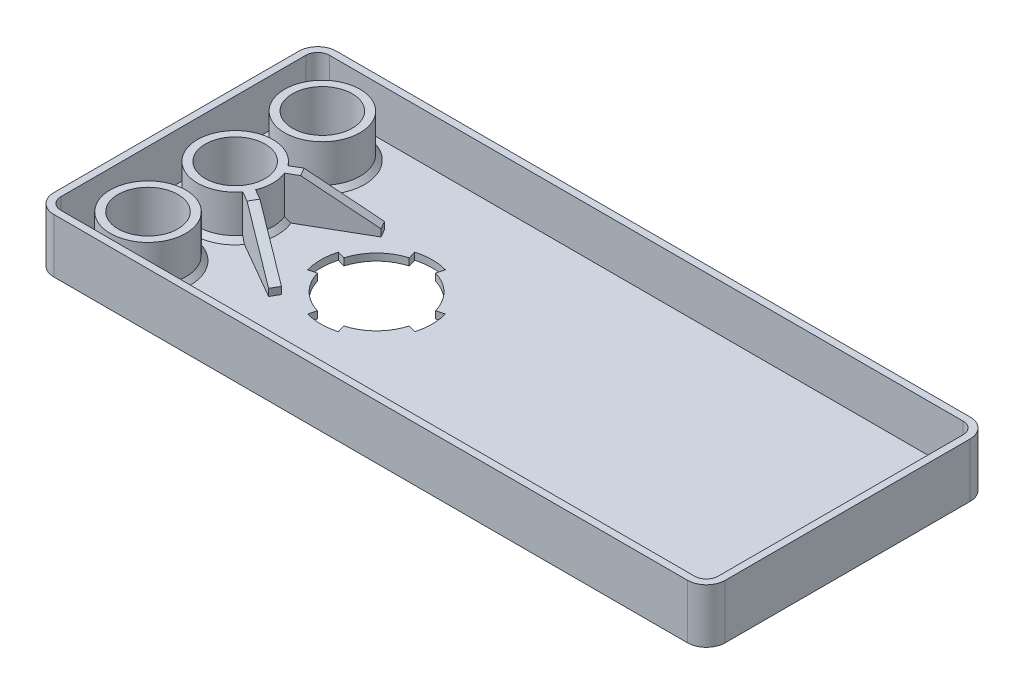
ISO-10303-21;
HEADER;
FILE_DESCRIPTION(('STEP AP214'),'2;1');
FILE_NAME('part.step','',(''),(''),'','','');
FILE_SCHEMA(('AUTOMOTIVE_DESIGN { 1 0 10303 214 1 1 1 1 }'));
ENDSEC;
DATA;
#1=APPLICATION_CONTEXT('core data for automotive mechanical design processes');
#2=APPLICATION_PROTOCOL_DEFINITION('international standard','automotive_design',2000,#1);
#3=PRODUCT_CONTEXT('',#1,'mechanical');
#4=PRODUCT('Part','Part','',(#3));
#5=PRODUCT_RELATED_PRODUCT_CATEGORY('part','',(#4));
#6=PRODUCT_DEFINITION_FORMATION('','',#4);
#7=PRODUCT_DEFINITION_CONTEXT('part definition',#1,'design');
#8=PRODUCT_DEFINITION('design','',#6,#7);
#9=PRODUCT_DEFINITION_SHAPE('','',#8);
#10=(LENGTH_UNIT() NAMED_UNIT(*) SI_UNIT(.MILLI.,.METRE.));
#11=(NAMED_UNIT(*) PLANE_ANGLE_UNIT() SI_UNIT($,.RADIAN.));
#12=(NAMED_UNIT(*) SI_UNIT($,.STERADIAN.) SOLID_ANGLE_UNIT());
#13=UNCERTAINTY_MEASURE_WITH_UNIT(LENGTH_MEASURE(1.E-05),#10,'distance_accuracy_value','');
#14=(GEOMETRIC_REPRESENTATION_CONTEXT(3) GLOBAL_UNCERTAINTY_ASSIGNED_CONTEXT((#13)) GLOBAL_UNIT_ASSIGNED_CONTEXT((#10,
#11,#12)) REPRESENTATION_CONTEXT('',''));
#15=CARTESIAN_POINT('',(0.,0.,0.));
#16=DIRECTION('',(0.,0.,1.));
#17=DIRECTION('',(1.,0.,0.));
#18=AXIS2_PLACEMENT_3D('',#15,#16,#17);
#19=CARTESIAN_POINT('',(134.5,3.,-52.));
#20=DIRECTION('',(0.,-1.,0.));
#21=DIRECTION('',(0.,0.,-1.));
#22=AXIS2_PLACEMENT_3D('',#19,#20,#21);
#23=PLANE('',#22);
#24=CARTESIAN_POINT('',(-117.5,3.,37.));
#25=DIRECTION('',(0.,-1.,0.));
#26=DIRECTION('',(0.,0.,-1.));
#27=AXIS2_PLACEMENT_3D('',#24,#25,#26);
#28=CIRCLE('',#27,18.);
#29=CARTESIAN_POINT('',(-117.5,3.,19.));
#30=VERTEX_POINT('',#29);
#31=EDGE_CURVE('E675',#30,#30,#28,.T.);
#32=ORIENTED_EDGE('',*,*,#31,.T.);
#33=EDGE_LOOP('',(#32));
#34=FACE_BOUND('',#33,.T.);
#35=CARTESIAN_POINT('',(-117.5,3.,-37.));
#36=DIRECTION('',(0.,-1.,0.));
#37=DIRECTION('',(0.,0.,-1.));
#38=AXIS2_PLACEMENT_3D('',#35,#36,#37);
#39=CIRCLE('',#38,18.);
#40=CARTESIAN_POINT('',(-117.5,3.,-55.));
#41=VERTEX_POINT('',#40);
#42=EDGE_CURVE('E672',#41,#41,#39,.T.);
#43=ORIENTED_EDGE('',*,*,#42,.T.);
#44=EDGE_LOOP('',(#43));
#45=FACE_BOUND('',#44,.T.);
#46=CARTESIAN_POINT('',(-57.5,3.,0.));
#47=DIRECTION('',(0.,1.,0.));
#48=DIRECTION('',(-1.,0.,0.));
#49=AXIS2_PLACEMENT_3D('',#46,#47,#48);
#50=CIRCLE('',#49,23.65);
#51=CARTESIAN_POINT('',(-50.9811765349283,3.,-22.7338391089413));
#52=VERTEX_POINT('',#51);
#53=CARTESIAN_POINT('',(-64.0188234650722,3.,-22.7338391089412));
#54=VERTEX_POINT('',#53);
#55=EDGE_CURVE('E445',#52,#54,#50,.T.);
#56=ORIENTED_EDGE('',*,*,#55,.F.);
#57=DIRECTION('',(0.275637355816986,0.,-0.961261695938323));
#58=VECTOR('',#57,1.);
#59=CARTESIAN_POINT('',(-50.9811765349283,3.,-22.7338391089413));
#60=LINE('',#59,#58);
#61=CARTESIAN_POINT('',(-51.918343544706,3.,-19.465549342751));
#62=VERTEX_POINT('',#61);
#63=EDGE_CURVE('E440',#62,#52,#60,.T.);
#64=ORIENTED_EDGE('',*,*,#63,.F.);
#65=CARTESIAN_POINT('',(-57.5,3.,0.));
#66=DIRECTION('',(0.,-1.,0.));
#67=DIRECTION('',(0.,0.,-1.));
#68=AXIS2_PLACEMENT_3D('',#65,#66,#67);
#69=CIRCLE('',#68,20.25);
#70=CARTESIAN_POINT('',(-38.034450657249,3.,-5.58165645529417));
#71=VERTEX_POINT('',#70);
#72=EDGE_CURVE('E668',#62,#71,#69,.T.);
#73=ORIENTED_EDGE('',*,*,#72,.T.);
#74=DIRECTION('',(-0.96126169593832,0.,0.275637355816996));
#75=VECTOR('',#74,1.);
#76=CARTESIAN_POINT('',(-57.5,3.,0.));
#77=LINE('',#76,#75);
#78=CARTESIAN_POINT('',(-34.7661608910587,3.,-6.51882346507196));
#79=VERTEX_POINT('',#78);
#80=EDGE_CURVE('E464',#79,#71,#77,.T.);
#81=ORIENTED_EDGE('',*,*,#80,.F.);
#82=CARTESIAN_POINT('',(-57.5,3.,0.));
#83=DIRECTION('',(0.,1.,0.));
#84=DIRECTION('',(0.,0.,-1.));
#85=AXIS2_PLACEMENT_3D('',#82,#83,#84);
#86=CIRCLE('',#85,23.65);
#87=CARTESIAN_POINT('',(-34.7661608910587,3.,6.51882346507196));
#88=VERTEX_POINT('',#87);
#89=EDGE_CURVE('E467',#88,#79,#86,.T.);
#90=ORIENTED_EDGE('',*,*,#89,.F.);
#91=DIRECTION('',(0.96126169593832,0.,0.275637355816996));
#92=VECTOR('',#91,1.);
#93=CARTESIAN_POINT('',(-34.7661608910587,3.,6.51882346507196));
#94=LINE('',#93,#92);
#95=CARTESIAN_POINT('',(-38.034450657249,3.,5.58165645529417));
#96=VERTEX_POINT('',#95);
#97=EDGE_CURVE('E461',#96,#88,#94,.T.);
#98=ORIENTED_EDGE('',*,*,#97,.F.);
#99=CARTESIAN_POINT('',(-51.9183435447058,3.,19.465549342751));
#100=VERTEX_POINT('',#99);
#101=EDGE_CURVE('E1262',#96,#100,#69,.T.);
#102=ORIENTED_EDGE('',*,*,#101,.T.);
#103=DIRECTION('',(-0.275637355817,0.,-0.961261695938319));
#104=VECTOR('',#103,1.);
#105=CARTESIAN_POINT('',(-57.5,3.,0.));
#106=LINE('',#105,#104);
#107=CARTESIAN_POINT('',(-50.981176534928,3.,22.7338391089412));
#108=VERTEX_POINT('',#107);
#109=EDGE_CURVE('E489',#108,#100,#106,.T.);
#110=ORIENTED_EDGE('',*,*,#109,.F.);
#111=CARTESIAN_POINT('',(-57.5,3.,0.));
#112=DIRECTION('',(0.,1.,0.));
#113=DIRECTION('',(1.,0.,0.));
#114=AXIS2_PLACEMENT_3D('',#111,#112,#113);
#115=CIRCLE('',#114,23.65);
#116=CARTESIAN_POINT('',(-64.0188234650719,3.,22.7338391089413));
#117=VERTEX_POINT('',#116);
#118=EDGE_CURVE('E463',#117,#108,#115,.T.);
#119=ORIENTED_EDGE('',*,*,#118,.F.);
#120=DIRECTION('',(-0.275637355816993,0.,0.961261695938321));
#121=VECTOR('',#120,1.);
#122=CARTESIAN_POINT('',(-64.0188234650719,3.,22.7338391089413));
#123=LINE('',#122,#121);
#124=CARTESIAN_POINT('',(-63.0816564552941,3.,19.465549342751));
#125=VERTEX_POINT('',#124);
#126=EDGE_CURVE('E480',#125,#117,#123,.T.);
#127=ORIENTED_EDGE('',*,*,#126,.F.);
#128=CARTESIAN_POINT('',(-76.965549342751,3.,5.58165645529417));
#129=VERTEX_POINT('',#128);
#130=EDGE_CURVE('E534',#125,#129,#69,.T.);
#131=ORIENTED_EDGE('',*,*,#130,.T.);
#132=DIRECTION('',(0.96126169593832,0.,-0.275637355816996));
#133=VECTOR('',#132,1.);
#134=CARTESIAN_POINT('',(-57.5,3.,0.));
#135=LINE('',#134,#133);
#136=CARTESIAN_POINT('',(-80.2338391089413,3.,6.51882346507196));
#137=VERTEX_POINT('',#136);
#138=EDGE_CURVE('E511',#137,#129,#135,.T.);
#139=ORIENTED_EDGE('',*,*,#138,.F.);
#140=CARTESIAN_POINT('',(-57.5,3.,0.));
#141=DIRECTION('',(0.,1.,0.));
#142=DIRECTION('',(0.,0.,1.));
#143=AXIS2_PLACEMENT_3D('',#140,#141,#142);
#144=CIRCLE('',#143,23.65);
#145=CARTESIAN_POINT('',(-80.2338391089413,3.,-6.51882346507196));
#146=VERTEX_POINT('',#145);
#147=EDGE_CURVE('E496',#146,#137,#144,.T.);
#148=ORIENTED_EDGE('',*,*,#147,.F.);
#149=DIRECTION('',(-0.96126169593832,0.,-0.275637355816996));
#150=VECTOR('',#149,1.);
#151=CARTESIAN_POINT('',(-80.2338391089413,3.,-6.51882346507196));
#152=LINE('',#151,#150);
#153=CARTESIAN_POINT('',(-76.965549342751,3.,-5.58165645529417));
#154=VERTEX_POINT('',#153);
#155=EDGE_CURVE('E502',#154,#146,#152,.T.);
#156=ORIENTED_EDGE('',*,*,#155,.F.);
#157=CARTESIAN_POINT('',(-63.0816564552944,3.,-19.4655493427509));
#158=VERTEX_POINT('',#157);
#159=EDGE_CURVE('E544',#154,#158,#69,.T.);
#160=ORIENTED_EDGE('',*,*,#159,.T.);
#161=DIRECTION('',(0.275637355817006,0.,0.961261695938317));
#162=VECTOR('',#161,1.);
#163=CARTESIAN_POINT('',(-57.5,3.,0.));
#164=LINE('',#163,#162);
#165=EDGE_CURVE('E443',#54,#158,#164,.T.);
#166=ORIENTED_EDGE('',*,*,#165,.F.);
#167=EDGE_LOOP('',(#56,#64,#73,#81,#90,#98,#102,#110,#119,#127,#131,#139,#148,#156,#160,#166));
#168=FACE_BOUND('',#167,.T.);
#169=CARTESIAN_POINT('',(134.5,3.,-52.));
#170=DIRECTION('',(0.,-1.,0.));
#171=DIRECTION('',(0.,0.,-1.));
#172=AXIS2_PLACEMENT_3D('',#169,#170,#171);
#173=CIRCLE('',#172,5.);
#174=CARTESIAN_POINT('',(139.5,3.,-52.));
#175=VERTEX_POINT('',#174);
#176=CARTESIAN_POINT('',(134.5,3.,-57.));
#177=VERTEX_POINT('',#176);
#178=EDGE_CURVE('E549',#175,#177,#173,.F.);
#179=ORIENTED_EDGE('',*,*,#178,.T.);
#180=DIRECTION('',(-1.,0.,0.));
#181=VECTOR('',#180,1.);
#182=CARTESIAN_POINT('',(134.5,3.,-57.));
#183=LINE('',#182,#181);
#184=CARTESIAN_POINT('',(-134.5,3.,-57.));
#185=VERTEX_POINT('',#184);
#186=EDGE_CURVE('E552',#177,#185,#183,.T.);
#187=ORIENTED_EDGE('',*,*,#186,.T.);
#188=CARTESIAN_POINT('',(-134.5,3.,-52.));
#189=DIRECTION('',(0.,-1.,0.));
#190=DIRECTION('',(0.,0.,-1.));
#191=AXIS2_PLACEMENT_3D('',#188,#189,#190);
#192=CIRCLE('',#191,5.);
#193=CARTESIAN_POINT('',(-139.5,3.,-52.));
#194=VERTEX_POINT('',#193);
#195=EDGE_CURVE('E564',#185,#194,#192,.F.);
#196=ORIENTED_EDGE('',*,*,#195,.T.);
#197=DIRECTION('',(0.,0.,1.));
#198=VECTOR('',#197,1.);
#199=CARTESIAN_POINT('',(-139.5,3.,-51.9999999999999));
#200=LINE('',#199,#198);
#201=CARTESIAN_POINT('',(-139.5,3.,52.));
#202=VERTEX_POINT('',#201);
#203=EDGE_CURVE('E569',#194,#202,#200,.T.);
#204=ORIENTED_EDGE('',*,*,#203,.T.);
#205=CARTESIAN_POINT('',(-134.5,3.,52.));
#206=DIRECTION('',(0.,-1.,0.));
#207=DIRECTION('',(0.,0.,-1.));
#208=AXIS2_PLACEMENT_3D('',#205,#206,#207);
#209=CIRCLE('',#208,4.99999999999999);
#210=CARTESIAN_POINT('',(-134.5,3.,57.));
#211=VERTEX_POINT('',#210);
#212=EDGE_CURVE('E574',#202,#211,#209,.F.);
#213=ORIENTED_EDGE('',*,*,#212,.T.);
#214=DIRECTION('',(1.,0.,0.));
#215=VECTOR('',#214,1.);
#216=CARTESIAN_POINT('',(134.5,3.,57.));
#217=LINE('',#216,#215);
#218=CARTESIAN_POINT('',(134.5,3.,57.));
#219=VERTEX_POINT('',#218);
#220=EDGE_CURVE('E579',#211,#219,#217,.T.);
#221=ORIENTED_EDGE('',*,*,#220,.T.);
#222=CARTESIAN_POINT('',(134.5,3.,52.));
#223=DIRECTION('',(0.,-1.,0.));
#224=DIRECTION('',(0.,0.,-1.));
#225=AXIS2_PLACEMENT_3D('',#222,#223,#224);
#226=CIRCLE('',#225,4.99999999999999);
#227=CARTESIAN_POINT('',(139.5,3.,52.));
#228=VERTEX_POINT('',#227);
#229=EDGE_CURVE('E584',#219,#228,#226,.F.);
#230=ORIENTED_EDGE('',*,*,#229,.T.);
#231=DIRECTION('',(0.,0.,-1.));
#232=VECTOR('',#231,1.);
#233=CARTESIAN_POINT('',(139.5,3.,-52.));
#234=LINE('',#233,#232);
#235=EDGE_CURVE('E588',#228,#175,#234,.T.);
#236=ORIENTED_EDGE('',*,*,#235,.T.);
#237=EDGE_LOOP('',(#179,#187,#196,#204,#213,#221,#230,#236));
#238=FACE_BOUND('',#237,.T.);
#239=DIRECTION('',(0.866025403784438,0.,-0.500000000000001));
#240=VECTOR('',#239,1.);
#241=CARTESIAN_POINT('',(-102.718471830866,3.,-6.12424893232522));
#242=LINE('',#241,#240);
#243=CARTESIAN_POINT('',(-100.973172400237,3.,-7.13189802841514));
#244=VERTEX_POINT('',#243);
#245=CARTESIAN_POINT('',(-76.7187225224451,3.,-21.1352111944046));
#246=VERTEX_POINT('',#245);
#247=EDGE_CURVE('E728',#244,#246,#242,.T.);
#248=ORIENTED_EDGE('',*,*,#247,.F.);
#249=CARTESIAN_POINT('',(-117.5,3.,0.));
#250=DIRECTION('',(0.,-1.,0.));
#251=DIRECTION('',(0.,0.,-1.));
#252=AXIS2_PLACEMENT_3D('',#249,#250,#251);
#253=CIRCLE('',#252,18.);
#254=CARTESIAN_POINT('',(-100.973172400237,3.,7.13189802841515));
#255=VERTEX_POINT('',#254);
#256=EDGE_CURVE('E665',#244,#255,#253,.T.);
#257=ORIENTED_EDGE('',*,*,#256,.T.);
#258=DIRECTION('',(-0.866025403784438,0.,-0.500000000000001));
#259=VECTOR('',#258,1.);
#260=CARTESIAN_POINT('',(-102.718471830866,3.,6.12424893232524));
#261=LINE('',#260,#259);
#262=CARTESIAN_POINT('',(-76.7187225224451,3.,21.1352111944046));
#263=VERTEX_POINT('',#262);
#264=EDGE_CURVE('E427',#263,#255,#261,.T.);
#265=ORIENTED_EDGE('',*,*,#264,.F.);
#266=DIRECTION('',(0.500000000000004,0.,-0.866025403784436));
#267=VECTOR('',#266,1.);
#268=CARTESIAN_POINT('',(-78.7187225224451,3.,24.5993128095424));
#269=LINE('',#268,#267);
#270=CARTESIAN_POINT('',(-78.7187225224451,3.,24.5993128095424));
#271=VERTEX_POINT('',#270);
#272=EDGE_CURVE('E420',#271,#263,#269,.T.);
#273=ORIENTED_EDGE('',*,*,#272,.F.);
#274=DIRECTION('',(0.866025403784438,0.,0.500000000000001));
#275=VECTOR('',#274,1.);
#276=CARTESIAN_POINT('',(-104.699484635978,3.,9.59931280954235));
#277=LINE('',#276,#275);
#278=CARTESIAN_POINT('',(-102.956322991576,3.,10.6057276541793));
#279=VERTEX_POINT('',#278);
#280=EDGE_CURVE('E715',#279,#271,#277,.T.);
#281=ORIENTED_EDGE('',*,*,#280,.F.);
#282=CARTESIAN_POINT('',(-102.956322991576,3.,-10.6057276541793));
#283=VERTEX_POINT('',#282);
#284=EDGE_CURVE('E669',#279,#283,#253,.T.);
#285=ORIENTED_EDGE('',*,*,#284,.T.);
#286=DIRECTION('',(-0.866025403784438,0.,0.500000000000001));
#287=VECTOR('',#286,1.);
#288=CARTESIAN_POINT('',(-104.699484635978,3.,-9.59931280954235));
#289=LINE('',#288,#287);
#290=CARTESIAN_POINT('',(-78.7187225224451,3.,-24.5993128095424));
#291=VERTEX_POINT('',#290);
#292=EDGE_CURVE('E731',#291,#283,#289,.T.);
#293=ORIENTED_EDGE('',*,*,#292,.F.);
#294=DIRECTION('',(-0.500000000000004,0.,-0.866025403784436));
#295=VECTOR('',#294,1.);
#296=CARTESIAN_POINT('',(-78.7187225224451,3.,-24.5993128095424));
#297=LINE('',#296,#295);
#298=EDGE_CURVE('E730',#246,#291,#297,.T.);
#299=ORIENTED_EDGE('',*,*,#298,.F.);
#300=EDGE_LOOP('',(#248,#257,#265,#273,#281,#285,#293,#299));
#301=FACE_BOUND('',#300,.T.);
#302=ADVANCED_FACE('F35',(#34,#45,#168,#238,#301),#23,.F.);
#303=CARTESIAN_POINT('',(-117.5,21.,0.));
#304=DIRECTION('',(0.,-1.,0.));
#305=DIRECTION('',(0.,0.,-1.));
#306=AXIS2_PLACEMENT_3D('',#303,#304,#305);
#307=CYLINDRICAL_SURFACE('',#306,16.);
#308=CARTESIAN_POINT('',(-117.5,4.99999999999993,0.));
#309=DIRECTION('',(0.,-1.,0.));
#310=DIRECTION('',(0.,0.,-1.));
#311=AXIS2_PLACEMENT_3D('',#308,#309,#310);
#312=CIRCLE('',#311,16.);
#313=CARTESIAN_POINT('',(-102.718471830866,4.99999999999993,6.12424893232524));
#314=VERTEX_POINT('',#313);
#315=CARTESIAN_POINT('',(-102.718471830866,4.99999999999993,-6.12424893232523));
#316=VERTEX_POINT('',#315);
#317=EDGE_CURVE('E340',#314,#316,#312,.F.);
#318=ORIENTED_EDGE('',*,*,#317,.T.);
#319=DIRECTION('',(0.,-1.,0.));
#320=VECTOR('',#319,1.);
#321=CARTESIAN_POINT('',(-102.718471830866,54.5298528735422,-6.12424893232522));
#322=LINE('',#321,#320);
#323=CARTESIAN_POINT('',(-102.718471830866,21.,-6.12424893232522));
#324=VERTEX_POINT('',#323);
#325=EDGE_CURVE('E321',#324,#316,#322,.T.);
#326=ORIENTED_EDGE('',*,*,#325,.F.);
#327=CARTESIAN_POINT('',(-117.5,21.,0.));
#328=DIRECTION('',(0.,-1.,0.));
#329=DIRECTION('',(0.,0.,-1.));
#330=AXIS2_PLACEMENT_3D('',#327,#328,#329);
#331=CIRCLE('',#330,16.);
#332=CARTESIAN_POINT('',(-102.718471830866,21.,6.12424893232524));
#333=VERTEX_POINT('',#332);
#334=EDGE_CURVE('E329',#324,#333,#331,.T.);
#335=ORIENTED_EDGE('',*,*,#334,.T.);
#336=DIRECTION('',(0.,-1.,0.));
#337=VECTOR('',#336,1.);
#338=CARTESIAN_POINT('',(-102.718471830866,54.5298528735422,6.12424893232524));
#339=LINE('',#338,#337);
#340=EDGE_CURVE('E423',#333,#314,#339,.T.);
#341=ORIENTED_EDGE('',*,*,#340,.T.);
#342=EDGE_LOOP('',(#318,#326,#335,#341));
#343=FACE_BOUND('',#342,.T.);
#344=ADVANCED_FACE('F338',(#343),#307,.T.);
#345=CARTESIAN_POINT('',(-104.699484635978,21.,9.59931280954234));
#346=VERTEX_POINT('',#345);
#347=CARTESIAN_POINT('',(-104.699484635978,21.,-9.59931280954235));
#348=VERTEX_POINT('',#347);
#349=EDGE_CURVE('E334',#346,#348,#331,.T.);
#350=ORIENTED_EDGE('',*,*,#349,.T.);
#351=DIRECTION('',(0.,-1.,0.));
#352=VECTOR('',#351,1.);
#353=CARTESIAN_POINT('',(-104.699484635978,54.5298528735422,-9.59931280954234));
#354=LINE('',#353,#352);
#355=CARTESIAN_POINT('',(-104.699484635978,4.99999999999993,-9.59931280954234));
#356=VERTEX_POINT('',#355);
#357=EDGE_CURVE('E326',#348,#356,#354,.T.);
#358=ORIENTED_EDGE('',*,*,#357,.T.);
#359=CARTESIAN_POINT('',(-104.699484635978,4.99999999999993,9.59931280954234));
#360=VERTEX_POINT('',#359);
#361=EDGE_CURVE('E684',#356,#360,#312,.F.);
#362=ORIENTED_EDGE('',*,*,#361,.T.);
#363=DIRECTION('',(0.,-1.,0.));
#364=VECTOR('',#363,1.);
#365=CARTESIAN_POINT('',(-104.699484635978,54.5298528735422,9.59931280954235));
#366=LINE('',#365,#364);
#367=EDGE_CURVE('E425',#346,#360,#366,.T.);
#368=ORIENTED_EDGE('',*,*,#367,.F.);
#369=EDGE_LOOP('',(#350,#358,#362,#368));
#370=FACE_BOUND('',#369,.T.);
#371=ADVANCED_FACE('F746',(#370),#307,.T.);
#372=CARTESIAN_POINT('',(-117.5,3.,0.));
#373=DIRECTION('',(0.,-1.,0.));
#374=DIRECTION('',(0.,0.,-1.));
#375=AXIS2_PLACEMENT_3D('',#372,#373,#374);
#376=CONICAL_SURFACE('',#375,18.,0.785398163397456);
#377=CARTESIAN_POINT('',(-102.718646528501,5.00019999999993,-6.12414807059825));
#378=CARTESIAN_POINT('',(-102.427574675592,4.6669517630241,-6.29219848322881));
#379=CARTESIAN_POINT('',(-102.136568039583,4.33362764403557,-6.4602112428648));
#380=CARTESIAN_POINT('',(-101.55468520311,3.66682764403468,-6.7961614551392));
#381=CARTESIAN_POINT('',(-101.263809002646,3.33335176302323,-6.96409890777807));
#382=CARTESIAN_POINT('',(-100.97299801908,2.9998,-7.13199870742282));
#383=B_SPLINE_CURVE_WITH_KNOTS('',3,(#377,#378,#379,#380,#381,#382),.UNSPECIFIED.,.F.,.F.,(4,2,
4),(0.,1.41991656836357,2.83983312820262),.UNSPECIFIED.);
#384=EDGE_CURVE('E356',#316,#244,#383,.T.);
#385=ORIENTED_EDGE('',*,*,#384,.F.);
#386=ORIENTED_EDGE('',*,*,#317,.F.);
#387=CARTESIAN_POINT('',(-100.97299801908,2.9998,7.13199870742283));
#388=CARTESIAN_POINT('',(-101.263809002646,3.33335176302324,6.96409890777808));
#389=CARTESIAN_POINT('',(-101.55468520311,3.66682764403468,6.79616145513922));
#390=CARTESIAN_POINT('',(-102.136568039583,4.33362764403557,6.46021124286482));
#391=CARTESIAN_POINT('',(-102.427574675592,4.6669517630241,6.29219848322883));
#392=CARTESIAN_POINT('',(-102.718646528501,5.00019999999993,6.12414807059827));
#393=B_SPLINE_CURVE_WITH_KNOTS('',3,(#387,#388,#389,#390,#391,#392),.UNSPECIFIED.,.F.,.F.,(4,2,
4),(0.,1.41991655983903,2.8398331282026),.UNSPECIFIED.);
#394=EDGE_CURVE('E382',#255,#314,#393,.T.);
#395=ORIENTED_EDGE('',*,*,#394,.F.);
#396=ORIENTED_EDGE('',*,*,#256,.F.);
#397=EDGE_LOOP('',(#385,#386,#395,#396));
#398=FACE_BOUND('',#397,.T.);
#399=ADVANCED_FACE('F362',(#398),#376,.T.);
#400=CARTESIAN_POINT('',(-102.956148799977,2.9998,-10.6058282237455));
#401=CARTESIAN_POINT('',(-103.246624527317,3.33332704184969,-10.438121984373));
#402=CARTESIAN_POINT('',(-103.537154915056,3.66679056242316,-10.2703841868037));
#403=CARTESIAN_POINT('',(-104.118325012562,4.33359056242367,-9.93484547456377));
#404=CARTESIAN_POINT('',(-104.408964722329,4.66692704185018,-9.76704455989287));
#405=CARTESIAN_POINT('',(-104.699659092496,5.00019999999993,-9.5992120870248));
#406=B_SPLINE_CURVE_WITH_KNOTS('',3,(#400,#401,#402,#403,#404,#405),.UNSPECIFIED.,.F.,.F.,(4,2,
4),(0.,1.41904057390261,2.83808115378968),.UNSPECIFIED.);
#407=EDGE_CURVE('E348',#283,#356,#406,.T.);
#408=ORIENTED_EDGE('',*,*,#407,.F.);
#409=ORIENTED_EDGE('',*,*,#284,.F.);
#410=CARTESIAN_POINT('',(-104.699659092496,5.00019999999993,9.5992120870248));
#411=CARTESIAN_POINT('',(-104.408964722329,4.66692704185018,9.76704455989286));
#412=CARTESIAN_POINT('',(-104.118325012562,4.33359056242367,9.93484547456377));
#413=CARTESIAN_POINT('',(-103.537154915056,3.66679056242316,10.2703841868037));
#414=CARTESIAN_POINT('',(-103.246624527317,3.33332704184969,10.438121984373));
#415=CARTESIAN_POINT('',(-102.956148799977,2.99979999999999,10.6058282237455));
#416=B_SPLINE_CURVE_WITH_KNOTS('',3,(#410,#411,#412,#413,#414,#415),.UNSPECIFIED.,.F.,.F.,(4,2,
4),(0.,1.41904057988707,2.83808115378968),.UNSPECIFIED.);
#417=EDGE_CURVE('E390',#360,#279,#416,.T.);
#418=ORIENTED_EDGE('',*,*,#417,.F.);
#419=ORIENTED_EDGE('',*,*,#361,.F.);
#420=EDGE_LOOP('',(#408,#409,#418,#419));
#421=FACE_BOUND('',#420,.T.);
#422=ADVANCED_FACE('F718',(#421),#376,.T.);
#423=CARTESIAN_POINT('',(-57.5,0.,0.));
#424=DIRECTION('',(0.,1.,0.));
#425=DIRECTION('',(0.,0.,1.));
#426=AXIS2_PLACEMENT_3D('',#423,#424,#425);
#427=CYLINDRICAL_SURFACE('',#426,20.25);
#428=ORIENTED_EDGE('',*,*,#72,.F.);
#429=DIRECTION('',(0.,1.,0.));
#430=VECTOR('',#429,1.);
#431=CARTESIAN_POINT('',(-51.918343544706,0.,-19.465549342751));
#432=LINE('',#431,#430);
#433=CARTESIAN_POINT('',(-51.918343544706,0.,-19.465549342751));
#434=VERTEX_POINT('',#433);
#435=EDGE_CURVE('E706',#62,#434,#432,.F.);
#436=ORIENTED_EDGE('',*,*,#435,.T.);
#437=CARTESIAN_POINT('',(-57.5,0.,0.));
#438=DIRECTION('',(0.,1.,0.));
#439=DIRECTION('',(0.,0.,1.));
#440=AXIS2_PLACEMENT_3D('',#437,#438,#439);
#441=CIRCLE('',#440,20.25);
#442=CARTESIAN_POINT('',(-38.034450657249,0.,-5.58165645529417));
#443=VERTEX_POINT('',#442);
#444=EDGE_CURVE('E1256',#443,#434,#441,.T.);
#445=ORIENTED_EDGE('',*,*,#444,.F.);
#446=DIRECTION('',(0.,1.,0.));
#447=VECTOR('',#446,1.);
#448=CARTESIAN_POINT('',(-38.034450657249,0.,-5.58165645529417));
#449=LINE('',#448,#447);
#450=EDGE_CURVE('E698',#443,#71,#449,.T.);
#451=ORIENTED_EDGE('',*,*,#450,.T.);
#452=EDGE_LOOP('',(#428,#436,#445,#451));
#453=FACE_BOUND('',#452,.T.);
#454=ADVANCED_FACE('F1034',(#453),#427,.F.);
#455=ORIENTED_EDGE('',*,*,#101,.F.);
#456=DIRECTION('',(0.,1.,0.));
#457=VECTOR('',#456,1.);
#458=CARTESIAN_POINT('',(-38.034450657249,0.,5.58165645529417));
#459=LINE('',#458,#457);
#460=CARTESIAN_POINT('',(-38.034450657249,0.,5.58165645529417));
#461=VERTEX_POINT('',#460);
#462=EDGE_CURVE('E701',#96,#461,#459,.F.);
#463=ORIENTED_EDGE('',*,*,#462,.T.);
#464=CARTESIAN_POINT('',(-51.9183435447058,0.,19.465549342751));
#465=VERTEX_POINT('',#464);
#466=EDGE_CURVE('E530',#465,#461,#441,.T.);
#467=ORIENTED_EDGE('',*,*,#466,.F.);
#468=DIRECTION('',(0.,1.,0.));
#469=VECTOR('',#468,1.);
#470=CARTESIAN_POINT('',(-51.9183435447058,0.,19.465549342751));
#471=LINE('',#470,#469);
#472=EDGE_CURVE('E692',#465,#100,#471,.T.);
#473=ORIENTED_EDGE('',*,*,#472,.T.);
#474=EDGE_LOOP('',(#455,#463,#467,#473));
#475=FACE_BOUND('',#474,.T.);
#476=ADVANCED_FACE('F1039',(#475),#427,.F.);
#477=ORIENTED_EDGE('',*,*,#130,.F.);
#478=DIRECTION('',(0.,1.,0.));
#479=VECTOR('',#478,1.);
#480=CARTESIAN_POINT('',(-63.0816564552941,0.,19.465549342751));
#481=LINE('',#480,#479);
#482=CARTESIAN_POINT('',(-63.0816564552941,0.,19.465549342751));
#483=VERTEX_POINT('',#482);
#484=EDGE_CURVE('E695',#125,#483,#481,.F.);
#485=ORIENTED_EDGE('',*,*,#484,.T.);
#486=CARTESIAN_POINT('',(-76.965549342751,0.,5.58165645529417));
#487=VERTEX_POINT('',#486);
#488=EDGE_CURVE('E527',#487,#483,#441,.T.);
#489=ORIENTED_EDGE('',*,*,#488,.F.);
#490=DIRECTION('',(0.,1.,0.));
#491=VECTOR('',#490,1.);
#492=CARTESIAN_POINT('',(-76.965549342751,0.,5.58165645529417));
#493=LINE('',#492,#491);
#494=EDGE_CURVE('E686',#487,#129,#493,.T.);
#495=ORIENTED_EDGE('',*,*,#494,.T.);
#496=EDGE_LOOP('',(#477,#485,#489,#495));
#497=FACE_BOUND('',#496,.T.);
#498=ADVANCED_FACE('F769',(#497),#427,.F.);
#499=CARTESIAN_POINT('',(134.5,23.,-52.));
#500=DIRECTION('',(0.,-1.,0.));
#501=DIRECTION('',(0.,0.,-1.));
#502=AXIS2_PLACEMENT_3D('',#499,#500,#501);
#503=PLANE('',#502);
#504=CARTESIAN_POINT('',(134.5,23.,-52.));
#505=DIRECTION('',(0.,1.,0.));
#506=DIRECTION('',(0.,0.,-1.));
#507=AXIS2_PLACEMENT_3D('',#504,#505,#506);
#508=CIRCLE('',#507,8.);
#509=CARTESIAN_POINT('',(142.5,23.,-52.));
#510=VERTEX_POINT('',#509);
#511=CARTESIAN_POINT('',(134.5,23.,-60.));
#512=VERTEX_POINT('',#511);
#513=EDGE_CURVE('E608',#510,#512,#508,.T.);
#514=ORIENTED_EDGE('',*,*,#513,.T.);
#515=DIRECTION('',(-1.,0.,0.));
#516=VECTOR('',#515,1.);
#517=CARTESIAN_POINT('',(-134.5,23.,-60.));
#518=LINE('',#517,#516);
#519=CARTESIAN_POINT('',(-134.5,23.,-60.));
#520=VERTEX_POINT('',#519);
#521=EDGE_CURVE('E611',#512,#520,#518,.T.);
#522=ORIENTED_EDGE('',*,*,#521,.T.);
#523=CARTESIAN_POINT('',(-134.5,23.,-52.));
#524=DIRECTION('',(0.,1.,0.));
#525=DIRECTION('',(0.,0.,-1.));
#526=AXIS2_PLACEMENT_3D('',#523,#524,#525);
#527=CIRCLE('',#526,8.);
#528=CARTESIAN_POINT('',(-142.5,23.,-52.));
#529=VERTEX_POINT('',#528);
#530=EDGE_CURVE('E614',#520,#529,#527,.T.);
#531=ORIENTED_EDGE('',*,*,#530,.T.);
#532=DIRECTION('',(0.,0.,1.));
#533=VECTOR('',#532,1.);
#534=CARTESIAN_POINT('',(-142.5,23.,-52.));
#535=LINE('',#534,#533);
#536=CARTESIAN_POINT('',(-142.5,23.,52.));
#537=VERTEX_POINT('',#536);
#538=EDGE_CURVE('E616',#529,#537,#535,.T.);
#539=ORIENTED_EDGE('',*,*,#538,.T.);
#540=CARTESIAN_POINT('',(-134.5,23.,52.));
#541=DIRECTION('',(0.,1.,0.));
#542=DIRECTION('',(0.,0.,-1.));
#543=AXIS2_PLACEMENT_3D('',#540,#541,#542);
#544=CIRCLE('',#543,7.99999999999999);
#545=CARTESIAN_POINT('',(-134.5,23.,60.));
#546=VERTEX_POINT('',#545);
#547=EDGE_CURVE('E618',#537,#546,#544,.T.);
#548=ORIENTED_EDGE('',*,*,#547,.T.);
#549=DIRECTION('',(1.,0.,0.));
#550=VECTOR('',#549,1.);
#551=CARTESIAN_POINT('',(-134.5,23.,60.));
#552=LINE('',#551,#550);
#553=CARTESIAN_POINT('',(134.5,23.,60.));
#554=VERTEX_POINT('',#553);
#555=EDGE_CURVE('E620',#546,#554,#552,.T.);
#556=ORIENTED_EDGE('',*,*,#555,.T.);
#557=CARTESIAN_POINT('',(134.5,23.,52.));
#558=DIRECTION('',(0.,1.,0.));
#559=DIRECTION('',(0.,0.,-1.));
#560=AXIS2_PLACEMENT_3D('',#557,#558,#559);
#561=CIRCLE('',#560,7.99999999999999);
#562=CARTESIAN_POINT('',(142.5,23.,52.));
#563=VERTEX_POINT('',#562);
#564=EDGE_CURVE('E622',#554,#563,#561,.T.);
#565=ORIENTED_EDGE('',*,*,#564,.T.);
#566=DIRECTION('',(0.,0.,-1.));
#567=VECTOR('',#566,1.);
#568=CARTESIAN_POINT('',(142.5,23.,-52.));
#569=LINE('',#568,#567);
#570=EDGE_CURVE('E624',#563,#510,#569,.T.);
#571=ORIENTED_EDGE('',*,*,#570,.T.);
#572=EDGE_LOOP('',(#514,#522,#531,#539,#548,#556,#565,#571));
#573=FACE_BOUND('',#572,.T.);
#574=CARTESIAN_POINT('',(134.5,23.,-52.));
#575=DIRECTION('',(0.,-1.,0.));
#576=DIRECTION('',(0.,0.,-1.));
#577=AXIS2_PLACEMENT_3D('',#574,#575,#576);
#578=CIRCLE('',#577,5.);
#579=CARTESIAN_POINT('',(139.5,23.,-52.));
#580=VERTEX_POINT('',#579);
#581=CARTESIAN_POINT('',(134.5,23.,-57.));
#582=VERTEX_POINT('',#581);
#583=EDGE_CURVE('E592',#580,#582,#578,.F.);
#584=ORIENTED_EDGE('',*,*,#583,.F.);
#585=DIRECTION('',(0.,0.,-1.));
#586=VECTOR('',#585,1.);
#587=CARTESIAN_POINT('',(139.5,23.,-52.));
#588=LINE('',#587,#586);
#589=CARTESIAN_POINT('',(139.5,23.,52.));
#590=VERTEX_POINT('',#589);
#591=EDGE_CURVE('E562',#590,#580,#588,.T.);
#592=ORIENTED_EDGE('',*,*,#591,.F.);
#593=CARTESIAN_POINT('',(134.5,23.,52.));
#594=DIRECTION('',(0.,-1.,0.));
#595=DIRECTION('',(0.,0.,-1.));
#596=AXIS2_PLACEMENT_3D('',#593,#594,#595);
#597=CIRCLE('',#596,4.99999999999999);
#598=CARTESIAN_POINT('',(134.5,23.,57.));
#599=VERTEX_POINT('',#598);
#600=EDGE_CURVE('E604',#599,#590,#597,.F.);
#601=ORIENTED_EDGE('',*,*,#600,.F.);
#602=DIRECTION('',(1.,0.,0.));
#603=VECTOR('',#602,1.);
#604=CARTESIAN_POINT('',(134.5,23.,57.));
#605=LINE('',#604,#603);
#606=CARTESIAN_POINT('',(-134.5,23.,57.));
#607=VERTEX_POINT('',#606);
#608=EDGE_CURVE('E602',#607,#599,#605,.T.);
#609=ORIENTED_EDGE('',*,*,#608,.F.);
#610=CARTESIAN_POINT('',(-134.5,23.,52.));
#611=DIRECTION('',(0.,-1.,0.));
#612=DIRECTION('',(0.,0.,-1.));
#613=AXIS2_PLACEMENT_3D('',#610,#611,#612);
#614=CIRCLE('',#613,4.99999999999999);
#615=CARTESIAN_POINT('',(-139.5,23.,52.));
#616=VERTEX_POINT('',#615);
#617=EDGE_CURVE('E600',#616,#607,#614,.F.);
#618=ORIENTED_EDGE('',*,*,#617,.F.);
#619=DIRECTION('',(0.,0.,1.));
#620=VECTOR('',#619,1.);
#621=CARTESIAN_POINT('',(-139.5,23.,-51.9999999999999));
#622=LINE('',#621,#620);
#623=CARTESIAN_POINT('',(-139.5,23.,-52.));
#624=VERTEX_POINT('',#623);
#625=EDGE_CURVE('E598',#624,#616,#622,.T.);
#626=ORIENTED_EDGE('',*,*,#625,.F.);
#627=CARTESIAN_POINT('',(-134.5,23.,-52.));
#628=DIRECTION('',(0.,-1.,0.));
#629=DIRECTION('',(0.,0.,-1.));
#630=AXIS2_PLACEMENT_3D('',#627,#628,#629);
#631=CIRCLE('',#630,5.);
#632=CARTESIAN_POINT('',(-134.5,23.,-57.));
#633=VERTEX_POINT('',#632);
#634=EDGE_CURVE('E596',#633,#624,#631,.F.);
#635=ORIENTED_EDGE('',*,*,#634,.F.);
#636=DIRECTION('',(-1.,0.,0.));
#637=VECTOR('',#636,1.);
#638=CARTESIAN_POINT('',(134.5,23.,-57.));
#639=LINE('',#638,#637);
#640=EDGE_CURVE('E594',#582,#633,#639,.T.);
#641=ORIENTED_EDGE('',*,*,#640,.F.);
#642=EDGE_LOOP('',(#584,#592,#601,#609,#618,#626,#635,#641));
#643=FACE_BOUND('',#642,.T.);
#644=ADVANCED_FACE('F765',(#573,#643),#503,.F.);
#645=CARTESIAN_POINT('',(134.5,23.,-52.));
#646=DIRECTION('',(0.,-1.,0.));
#647=DIRECTION('',(0.,0.,-1.));
#648=AXIS2_PLACEMENT_3D('',#645,#646,#647);
#649=CYLINDRICAL_SURFACE('',#648,8.);
#650=CARTESIAN_POINT('',(134.5,0.,-52.));
#651=DIRECTION('',(0.,1.,0.));
#652=DIRECTION('',(0.,0.,-1.));
#653=AXIS2_PLACEMENT_3D('',#650,#651,#652);
#654=CIRCLE('',#653,8.);
#655=CARTESIAN_POINT('',(142.5,0.,-52.));
#656=VERTEX_POINT('',#655);
#657=CARTESIAN_POINT('',(134.5,0.,-60.));
#658=VERTEX_POINT('',#657);
#659=EDGE_CURVE('E556',#656,#658,#654,.T.);
#660=ORIENTED_EDGE('',*,*,#659,.T.);
#661=DIRECTION('',(0.,-1.,0.));
#662=VECTOR('',#661,1.);
#663=CARTESIAN_POINT('',(134.5,23.,-60.));
#664=LINE('',#663,#662);
#665=EDGE_CURVE('E662',#512,#658,#664,.T.);
#666=ORIENTED_EDGE('',*,*,#665,.F.);
#667=ORIENTED_EDGE('',*,*,#513,.F.);
#668=DIRECTION('',(0.,-1.,0.));
#669=VECTOR('',#668,1.);
#670=CARTESIAN_POINT('',(142.5,23.,-52.));
#671=LINE('',#670,#669);
#672=EDGE_CURVE('E626',#510,#656,#671,.T.);
#673=ORIENTED_EDGE('',*,*,#672,.T.);
#674=EDGE_LOOP('',(#660,#666,#667,#673));
#675=FACE_BOUND('',#674,.T.);
#676=ADVANCED_FACE('F768',(#675),#649,.T.);
#677=CARTESIAN_POINT('',(-134.5,23.,-60.));
#678=DIRECTION('',(0.,0.,1.));
#679=DIRECTION('',(1.,0.,0.));
#680=AXIS2_PLACEMENT_3D('',#677,#678,#679);
#681=PLANE('',#680);
#682=DIRECTION('',(-1.,0.,0.));
#683=VECTOR('',#682,1.);
#684=CARTESIAN_POINT('',(-134.5,0.,-60.));
#685=LINE('',#684,#683);
#686=CARTESIAN_POINT('',(-134.5,0.,-60.));
#687=VERTEX_POINT('',#686);
#688=EDGE_CURVE('E629',#658,#687,#685,.T.);
#689=ORIENTED_EDGE('',*,*,#688,.T.);
#690=DIRECTION('',(0.,-1.,0.));
#691=VECTOR('',#690,1.);
#692=CARTESIAN_POINT('',(-134.5,23.,-60.));
#693=LINE('',#692,#691);
#694=EDGE_CURVE('E659',#520,#687,#693,.T.);
#695=ORIENTED_EDGE('',*,*,#694,.F.);
#696=ORIENTED_EDGE('',*,*,#521,.F.);
#697=ORIENTED_EDGE('',*,*,#665,.T.);
#698=EDGE_LOOP('',(#689,#695,#696,#697));
#699=FACE_BOUND('',#698,.T.);
#700=ADVANCED_FACE('F799',(#699),#681,.F.);
#701=CARTESIAN_POINT('',(-134.5,23.,-52.));
#702=DIRECTION('',(0.,-1.,0.));
#703=DIRECTION('',(0.,0.,-1.));
#704=AXIS2_PLACEMENT_3D('',#701,#702,#703);
#705=CYLINDRICAL_SURFACE('',#704,8.);
#706=CARTESIAN_POINT('',(-134.5,0.,-52.));
#707=DIRECTION('',(0.,1.,0.));
#708=DIRECTION('',(0.,0.,-1.));
#709=AXIS2_PLACEMENT_3D('',#706,#707,#708);
#710=CIRCLE('',#709,8.);
#711=CARTESIAN_POINT('',(-142.5,0.,-52.));
#712=VERTEX_POINT('',#711);
#713=EDGE_CURVE('E631',#687,#712,#710,.T.);
#714=ORIENTED_EDGE('',*,*,#713,.T.);
#715=DIRECTION('',(0.,-1.,0.));
#716=VECTOR('',#715,1.);
#717=CARTESIAN_POINT('',(-142.5,23.,-52.));
#718=LINE('',#717,#716);
#719=EDGE_CURVE('E656',#529,#712,#718,.T.);
#720=ORIENTED_EDGE('',*,*,#719,.F.);
#721=ORIENTED_EDGE('',*,*,#530,.F.);
#722=ORIENTED_EDGE('',*,*,#694,.T.);
#723=EDGE_LOOP('',(#714,#720,#721,#722));
#724=FACE_BOUND('',#723,.T.);
#725=ADVANCED_FACE('F795',(#724),#705,.T.);
#726=CARTESIAN_POINT('',(-142.5,23.,-52.));
#727=DIRECTION('',(1.,0.,0.));
#728=DIRECTION('',(0.,0.,-1.));
#729=AXIS2_PLACEMENT_3D('',#726,#727,#728);
#730=PLANE('',#729);
#731=DIRECTION('',(0.,0.,1.));
#732=VECTOR('',#731,1.);
#733=CARTESIAN_POINT('',(-142.5,0.,-52.));
#734=LINE('',#733,#732);
#735=CARTESIAN_POINT('',(-142.5,0.,52.));
#736=VERTEX_POINT('',#735);
#737=EDGE_CURVE('E633',#712,#736,#734,.T.);
#738=ORIENTED_EDGE('',*,*,#737,.T.);
#739=DIRECTION('',(0.,-1.,0.));
#740=VECTOR('',#739,1.);
#741=CARTESIAN_POINT('',(-142.5,23.,52.));
#742=LINE('',#741,#740);
#743=EDGE_CURVE('E653',#537,#736,#742,.T.);
#744=ORIENTED_EDGE('',*,*,#743,.F.);
#745=ORIENTED_EDGE('',*,*,#538,.F.);
#746=ORIENTED_EDGE('',*,*,#719,.T.);
#747=EDGE_LOOP('',(#738,#744,#745,#746));
#748=FACE_BOUND('',#747,.T.);
#749=ADVANCED_FACE('F791',(#748),#730,.F.);
#750=CARTESIAN_POINT('',(-134.5,23.,52.));
#751=DIRECTION('',(0.,-1.,0.));
#752=DIRECTION('',(0.,0.,-1.));
#753=AXIS2_PLACEMENT_3D('',#750,#751,#752);
#754=CYLINDRICAL_SURFACE('',#753,7.99999999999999);
#755=CARTESIAN_POINT('',(-134.5,0.,52.));
#756=DIRECTION('',(0.,1.,0.));
#757=DIRECTION('',(0.,0.,-1.));
#758=AXIS2_PLACEMENT_3D('',#755,#756,#757);
#759=CIRCLE('',#758,7.99999999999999);
#760=CARTESIAN_POINT('',(-134.5,0.,60.));
#761=VERTEX_POINT('',#760);
#762=EDGE_CURVE('E635',#736,#761,#759,.T.);
#763=ORIENTED_EDGE('',*,*,#762,.T.);
#764=DIRECTION('',(0.,-1.,0.));
#765=VECTOR('',#764,1.);
#766=CARTESIAN_POINT('',(-134.5,23.,60.));
#767=LINE('',#766,#765);
#768=EDGE_CURVE('E650',#546,#761,#767,.T.);
#769=ORIENTED_EDGE('',*,*,#768,.F.);
#770=ORIENTED_EDGE('',*,*,#547,.F.);
#771=ORIENTED_EDGE('',*,*,#743,.T.);
#772=EDGE_LOOP('',(#763,#769,#770,#771));
#773=FACE_BOUND('',#772,.T.);
#774=ADVANCED_FACE('F787',(#773),#754,.T.);
#775=CARTESIAN_POINT('',(-134.5,23.,60.));
#776=DIRECTION('',(0.,0.,-1.));
#777=DIRECTION('',(-1.,0.,0.));
#778=AXIS2_PLACEMENT_3D('',#775,#776,#777);
#779=PLANE('',#778);
#780=DIRECTION('',(1.,0.,0.));
#781=VECTOR('',#780,1.);
#782=CARTESIAN_POINT('',(-134.5,0.,60.));
#783=LINE('',#782,#781);
#784=CARTESIAN_POINT('',(134.5,0.,60.));
#785=VERTEX_POINT('',#784);
#786=EDGE_CURVE('E637',#761,#785,#783,.T.);
#787=ORIENTED_EDGE('',*,*,#786,.T.);
#788=DIRECTION('',(0.,-1.,0.));
#789=VECTOR('',#788,1.);
#790=CARTESIAN_POINT('',(134.5,23.,60.));
#791=LINE('',#790,#789);
#792=EDGE_CURVE('E647',#554,#785,#791,.T.);
#793=ORIENTED_EDGE('',*,*,#792,.F.);
#794=ORIENTED_EDGE('',*,*,#555,.F.);
#795=ORIENTED_EDGE('',*,*,#768,.T.);
#796=EDGE_LOOP('',(#787,#793,#794,#795));
#797=FACE_BOUND('',#796,.T.);
#798=ADVANCED_FACE('F783',(#797),#779,.F.);
#799=CARTESIAN_POINT('',(134.5,23.,52.));
#800=DIRECTION('',(0.,-1.,0.));
#801=DIRECTION('',(0.,0.,-1.));
#802=AXIS2_PLACEMENT_3D('',#799,#800,#801);
#803=CYLINDRICAL_SURFACE('',#802,7.99999999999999);
#804=CARTESIAN_POINT('',(134.5,0.,52.));
#805=DIRECTION('',(0.,1.,0.));
#806=DIRECTION('',(0.,0.,-1.));
#807=AXIS2_PLACEMENT_3D('',#804,#805,#806);
#808=CIRCLE('',#807,7.99999999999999);
#809=CARTESIAN_POINT('',(142.5,0.,52.));
#810=VERTEX_POINT('',#809);
#811=EDGE_CURVE('E639',#785,#810,#808,.T.);
#812=ORIENTED_EDGE('',*,*,#811,.T.);
#813=DIRECTION('',(0.,-1.,0.));
#814=VECTOR('',#813,1.);
#815=CARTESIAN_POINT('',(142.5,23.,52.));
#816=LINE('',#815,#814);
#817=EDGE_CURVE('E644',#563,#810,#816,.T.);
#818=ORIENTED_EDGE('',*,*,#817,.F.);
#819=ORIENTED_EDGE('',*,*,#564,.F.);
#820=ORIENTED_EDGE('',*,*,#792,.T.);
#821=EDGE_LOOP('',(#812,#818,#819,#820));
#822=FACE_BOUND('',#821,.T.);
#823=ADVANCED_FACE('F779',(#822),#803,.T.);
#824=CARTESIAN_POINT('',(142.5,23.,-52.));
#825=DIRECTION('',(-1.,0.,0.));
#826=DIRECTION('',(0.,0.,1.));
#827=AXIS2_PLACEMENT_3D('',#824,#825,#826);
#828=PLANE('',#827);
#829=DIRECTION('',(0.,0.,-1.));
#830=VECTOR('',#829,1.);
#831=CARTESIAN_POINT('',(142.5,0.,-52.));
#832=LINE('',#831,#830);
#833=EDGE_CURVE('E612',#810,#656,#832,.T.);
#834=ORIENTED_EDGE('',*,*,#833,.T.);
#835=ORIENTED_EDGE('',*,*,#672,.F.);
#836=ORIENTED_EDGE('',*,*,#570,.F.);
#837=ORIENTED_EDGE('',*,*,#817,.T.);
#838=EDGE_LOOP('',(#834,#835,#836,#837));
#839=FACE_BOUND('',#838,.T.);
#840=ADVANCED_FACE('F775',(#839),#828,.F.);
#841=CARTESIAN_POINT('',(134.5,0.,-52.));
#842=DIRECTION('',(0.,-1.,0.));
#843=DIRECTION('',(0.,0.,-1.));
#844=AXIS2_PLACEMENT_3D('',#841,#842,#843);
#845=PLANE('',#844);
#846=DIRECTION('',(0.275637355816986,0.,-0.961261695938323));
#847=VECTOR('',#846,1.);
#848=CARTESIAN_POINT('',(-50.9811765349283,0.,-22.7338391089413));
#849=LINE('',#848,#847);
#850=CARTESIAN_POINT('',(-50.9811765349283,0.,-22.7338391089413));
#851=VERTEX_POINT('',#850);
#852=EDGE_CURVE('E435',#434,#851,#849,.T.);
#853=ORIENTED_EDGE('',*,*,#852,.T.);
#854=CARTESIAN_POINT('',(-57.5,0.,0.));
#855=DIRECTION('',(0.,1.,0.));
#856=DIRECTION('',(-1.,0.,0.));
#857=AXIS2_PLACEMENT_3D('',#854,#855,#856);
#858=CIRCLE('',#857,23.65);
#859=CARTESIAN_POINT('',(-64.0188234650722,0.,-22.7338391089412));
#860=VERTEX_POINT('',#859);
#861=EDGE_CURVE('E415',#851,#860,#858,.T.);
#862=ORIENTED_EDGE('',*,*,#861,.T.);
#863=DIRECTION('',(0.275637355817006,0.,0.961261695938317));
#864=VECTOR('',#863,1.);
#865=CARTESIAN_POINT('',(-57.5,0.,0.));
#866=LINE('',#865,#864);
#867=CARTESIAN_POINT('',(-63.0816564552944,0.,-19.4655493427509));
#868=VERTEX_POINT('',#867);
#869=EDGE_CURVE('E439',#860,#868,#866,.T.);
#870=ORIENTED_EDGE('',*,*,#869,.T.);
#871=CARTESIAN_POINT('',(-76.965549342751,0.,-5.58165645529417));
#872=VERTEX_POINT('',#871);
#873=EDGE_CURVE('E518',#868,#872,#441,.T.);
#874=ORIENTED_EDGE('',*,*,#873,.T.);
#875=DIRECTION('',(-0.96126169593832,0.,-0.275637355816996));
#876=VECTOR('',#875,1.);
#877=CARTESIAN_POINT('',(-80.2338391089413,0.,-6.51882346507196));
#878=LINE('',#877,#876);
#879=CARTESIAN_POINT('',(-80.2338391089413,0.,-6.51882346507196));
#880=VERTEX_POINT('',#879);
#881=EDGE_CURVE('E505',#872,#880,#878,.T.);
#882=ORIENTED_EDGE('',*,*,#881,.T.);
#883=CARTESIAN_POINT('',(-57.5,0.,0.));
#884=DIRECTION('',(0.,1.,0.));
#885=DIRECTION('',(0.,0.,1.));
#886=AXIS2_PLACEMENT_3D('',#883,#884,#885);
#887=CIRCLE('',#886,23.65);
#888=CARTESIAN_POINT('',(-80.2338391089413,0.,6.51882346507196));
#889=VERTEX_POINT('',#888);
#890=EDGE_CURVE('E498',#880,#889,#887,.T.);
#891=ORIENTED_EDGE('',*,*,#890,.T.);
#892=DIRECTION('',(0.96126169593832,0.,-0.275637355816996));
#893=VECTOR('',#892,1.);
#894=CARTESIAN_POINT('',(-57.5,0.,0.));
#895=LINE('',#894,#893);
#896=EDGE_CURVE('E501',#889,#487,#895,.T.);
#897=ORIENTED_EDGE('',*,*,#896,.T.);
#898=ORIENTED_EDGE('',*,*,#488,.T.);
#899=DIRECTION('',(-0.275637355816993,0.,0.961261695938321));
#900=VECTOR('',#899,1.);
#901=CARTESIAN_POINT('',(-64.0188234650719,0.,22.7338391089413));
#902=LINE('',#901,#900);
#903=CARTESIAN_POINT('',(-64.0188234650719,0.,22.7338391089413));
#904=VERTEX_POINT('',#903);
#905=EDGE_CURVE('E483',#483,#904,#902,.T.);
#906=ORIENTED_EDGE('',*,*,#905,.T.);
#907=CARTESIAN_POINT('',(-57.5,0.,0.));
#908=DIRECTION('',(0.,1.,0.));
#909=DIRECTION('',(1.,0.,0.));
#910=AXIS2_PLACEMENT_3D('',#907,#908,#909);
#911=CIRCLE('',#910,23.65);
#912=CARTESIAN_POINT('',(-50.981176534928,0.,22.7338391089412));
#913=VERTEX_POINT('',#912);
#914=EDGE_CURVE('E476',#904,#913,#911,.T.);
#915=ORIENTED_EDGE('',*,*,#914,.T.);
#916=DIRECTION('',(-0.275637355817,0.,-0.961261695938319));
#917=VECTOR('',#916,1.);
#918=CARTESIAN_POINT('',(-57.5,0.,0.));
#919=LINE('',#918,#917);
#920=EDGE_CURVE('E479',#913,#465,#919,.T.);
#921=ORIENTED_EDGE('',*,*,#920,.T.);
#922=ORIENTED_EDGE('',*,*,#466,.T.);
#923=DIRECTION('',(0.96126169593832,0.,0.275637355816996));
#924=VECTOR('',#923,1.);
#925=CARTESIAN_POINT('',(-34.7661608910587,0.,6.51882346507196));
#926=LINE('',#925,#924);
#927=CARTESIAN_POINT('',(-34.7661608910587,0.,6.51882346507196));
#928=VERTEX_POINT('',#927);
#929=EDGE_CURVE('E456',#461,#928,#926,.T.);
#930=ORIENTED_EDGE('',*,*,#929,.T.);
#931=CARTESIAN_POINT('',(-57.5,0.,0.));
#932=DIRECTION('',(0.,1.,0.));
#933=DIRECTION('',(0.,0.,-1.));
#934=AXIS2_PLACEMENT_3D('',#931,#932,#933);
#935=CIRCLE('',#934,23.65);
#936=CARTESIAN_POINT('',(-34.7661608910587,0.,-6.51882346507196));
#937=VERTEX_POINT('',#936);
#938=EDGE_CURVE('E442',#928,#937,#935,.T.);
#939=ORIENTED_EDGE('',*,*,#938,.T.);
#940=DIRECTION('',(-0.96126169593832,0.,0.275637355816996));
#941=VECTOR('',#940,1.);
#942=CARTESIAN_POINT('',(-57.5,0.,0.));
#943=LINE('',#942,#941);
#944=EDGE_CURVE('E460',#937,#443,#943,.T.);
#945=ORIENTED_EDGE('',*,*,#944,.T.);
#946=ORIENTED_EDGE('',*,*,#444,.T.);
#947=EDGE_LOOP('',(#853,#862,#870,#874,#882,#891,#897,#898,#906,#915,#921,#922,#930,#939,#945,#946));
#948=FACE_BOUND('',#947,.T.);
#949=CARTESIAN_POINT('',(-117.5,0.,37.));
#950=DIRECTION('',(0.,1.,0.));
#951=DIRECTION('',(0.,0.,1.));
#952=AXIS2_PLACEMENT_3D('',#949,#950,#951);
#953=CIRCLE('',#952,12.7);
#954=CARTESIAN_POINT('',(-117.5,0.,49.7));
#955=VERTEX_POINT('',#954);
#956=EDGE_CURVE('E520',#955,#955,#953,.T.);
#957=ORIENTED_EDGE('',*,*,#956,.T.);
#958=EDGE_LOOP('',(#957));
#959=FACE_BOUND('',#958,.T.);
#960=CARTESIAN_POINT('',(-117.5,0.,0.));
#961=DIRECTION('',(0.,1.,0.));
#962=DIRECTION('',(0.,0.,1.));
#963=AXIS2_PLACEMENT_3D('',#960,#961,#962);
#964=CIRCLE('',#963,12.7);
#965=CARTESIAN_POINT('',(-117.5,0.,12.7));
#966=VERTEX_POINT('',#965);
#967=EDGE_CURVE('E531',#966,#966,#964,.T.);
#968=ORIENTED_EDGE('',*,*,#967,.T.);
#969=EDGE_LOOP('',(#968));
#970=FACE_BOUND('',#969,.T.);
#971=CARTESIAN_POINT('',(-117.5,0.,-37.));
#972=DIRECTION('',(0.,1.,0.));
#973=DIRECTION('',(0.,0.,1.));
#974=AXIS2_PLACEMENT_3D('',#971,#972,#973);
#975=CIRCLE('',#974,12.7);
#976=CARTESIAN_POINT('',(-117.5,0.,-24.3));
#977=VERTEX_POINT('',#976);
#978=EDGE_CURVE('E537',#977,#977,#975,.T.);
#979=ORIENTED_EDGE('',*,*,#978,.T.);
#980=EDGE_LOOP('',(#979));
#981=FACE_BOUND('',#980,.T.);
#982=ORIENTED_EDGE('',*,*,#659,.F.);
#983=ORIENTED_EDGE('',*,*,#833,.F.);
#984=ORIENTED_EDGE('',*,*,#811,.F.);
#985=ORIENTED_EDGE('',*,*,#786,.F.);
#986=ORIENTED_EDGE('',*,*,#762,.F.);
#987=ORIENTED_EDGE('',*,*,#737,.F.);
#988=ORIENTED_EDGE('',*,*,#713,.F.);
#989=ORIENTED_EDGE('',*,*,#688,.F.);
#990=EDGE_LOOP('',(#982,#983,#984,#985,#986,#987,#988,#989));
#991=FACE_BOUND('',#990,.T.);
#992=ADVANCED_FACE('F771',(#948,#959,#970,#981,#991),#845,.T.);
#993=CARTESIAN_POINT('',(134.5,23.,-52.));
#994=DIRECTION('',(0.,-1.,0.));
#995=DIRECTION('',(0.,0.,-1.));
#996=AXIS2_PLACEMENT_3D('',#993,#994,#995);
#997=CYLINDRICAL_SURFACE('',#996,5.);
#998=ORIENTED_EDGE('',*,*,#178,.F.);
#999=DIRECTION('',(0.,-1.,0.));
#1000=VECTOR('',#999,1.);
#1001=CARTESIAN_POINT('',(139.5,23.,-52.));
#1002=LINE('',#1001,#1000);
#1003=EDGE_CURVE('E558',#580,#175,#1002,.T.);
#1004=ORIENTED_EDGE('',*,*,#1003,.F.);
#1005=ORIENTED_EDGE('',*,*,#583,.T.);
#1006=DIRECTION('',(0.,1.,0.));
#1007=VECTOR('',#1006,1.);
#1008=CARTESIAN_POINT('',(134.5,23.,-57.));
#1009=LINE('',#1008,#1007);
#1010=EDGE_CURVE('E553',#582,#177,#1009,.F.);
#1011=ORIENTED_EDGE('',*,*,#1010,.T.);
#1012=EDGE_LOOP('',(#998,#1004,#1005,#1011));
#1013=FACE_BOUND('',#1012,.T.);
#1014=ADVANCED_FACE('F774',(#1013),#997,.F.);
#1015=CARTESIAN_POINT('',(-134.5,23.,-57.));
#1016=DIRECTION('',(0.,0.,1.));
#1017=DIRECTION('',(1.,0.,0.));
#1018=AXIS2_PLACEMENT_3D('',#1015,#1016,#1017);
#1019=PLANE('',#1018);
#1020=ORIENTED_EDGE('',*,*,#186,.F.);
#1021=ORIENTED_EDGE('',*,*,#1010,.F.);
#1022=ORIENTED_EDGE('',*,*,#640,.T.);
#1023=DIRECTION('',(0.,-1.,0.));
#1024=VECTOR('',#1023,1.);
#1025=CARTESIAN_POINT('',(-134.5,23.,-57.));
#1026=LINE('',#1025,#1024);
#1027=EDGE_CURVE('E557',#633,#185,#1026,.T.);
#1028=ORIENTED_EDGE('',*,*,#1027,.T.);
#1029=EDGE_LOOP('',(#1020,#1021,#1022,#1028));
#1030=FACE_BOUND('',#1029,.T.);
#1031=ADVANCED_FACE('F837',(#1030),#1019,.T.);
#1032=CARTESIAN_POINT('',(-134.5,23.,-52.));
#1033=DIRECTION('',(0.,-1.,0.));
#1034=DIRECTION('',(0.,0.,-1.));
#1035=AXIS2_PLACEMENT_3D('',#1032,#1033,#1034);
#1036=CYLINDRICAL_SURFACE('',#1035,5.);
#1037=ORIENTED_EDGE('',*,*,#195,.F.);
#1038=ORIENTED_EDGE('',*,*,#1027,.F.);
#1039=ORIENTED_EDGE('',*,*,#634,.T.);
#1040=DIRECTION('',(0.,1.,0.));
#1041=VECTOR('',#1040,1.);
#1042=CARTESIAN_POINT('',(-139.5,23.,-52.));
#1043=LINE('',#1042,#1041);
#1044=EDGE_CURVE('E567',#624,#194,#1043,.F.);
#1045=ORIENTED_EDGE('',*,*,#1044,.T.);
#1046=EDGE_LOOP('',(#1037,#1038,#1039,#1045));
#1047=FACE_BOUND('',#1046,.T.);
#1048=ADVANCED_FACE('F847',(#1047),#1036,.F.);
#1049=CARTESIAN_POINT('',(-139.5,23.,-52.));
#1050=DIRECTION('',(1.,0.,0.));
#1051=DIRECTION('',(0.,0.,-1.));
#1052=AXIS2_PLACEMENT_3D('',#1049,#1050,#1051);
#1053=PLANE('',#1052);
#1054=ORIENTED_EDGE('',*,*,#203,.F.);
#1055=ORIENTED_EDGE('',*,*,#1044,.F.);
#1056=ORIENTED_EDGE('',*,*,#625,.T.);
#1057=DIRECTION('',(0.,-1.,0.));
#1058=VECTOR('',#1057,1.);
#1059=CARTESIAN_POINT('',(-139.5,23.,52.));
#1060=LINE('',#1059,#1058);
#1061=EDGE_CURVE('E572',#616,#202,#1060,.T.);
#1062=ORIENTED_EDGE('',*,*,#1061,.T.);
#1063=EDGE_LOOP('',(#1054,#1055,#1056,#1062));
#1064=FACE_BOUND('',#1063,.T.);
#1065=ADVANCED_FACE('F850',(#1064),#1053,.T.);
#1066=CARTESIAN_POINT('',(-134.5,23.,52.));
#1067=DIRECTION('',(0.,-1.,0.));
#1068=DIRECTION('',(0.,0.,-1.));
#1069=AXIS2_PLACEMENT_3D('',#1066,#1067,#1068);
#1070=CYLINDRICAL_SURFACE('',#1069,4.99999999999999);
#1071=ORIENTED_EDGE('',*,*,#212,.F.);
#1072=ORIENTED_EDGE('',*,*,#1061,.F.);
#1073=ORIENTED_EDGE('',*,*,#617,.T.);
#1074=DIRECTION('',(0.,1.,0.));
#1075=VECTOR('',#1074,1.);
#1076=CARTESIAN_POINT('',(-134.5,23.,57.));
#1077=LINE('',#1076,#1075);
#1078=EDGE_CURVE('E577',#607,#211,#1077,.F.);
#1079=ORIENTED_EDGE('',*,*,#1078,.T.);
#1080=EDGE_LOOP('',(#1071,#1072,#1073,#1079));
#1081=FACE_BOUND('',#1080,.T.);
#1082=ADVANCED_FACE('F856',(#1081),#1070,.F.);
#1083=CARTESIAN_POINT('',(-134.5,23.,57.));
#1084=DIRECTION('',(0.,0.,-1.));
#1085=DIRECTION('',(-1.,0.,0.));
#1086=AXIS2_PLACEMENT_3D('',#1083,#1084,#1085);
#1087=PLANE('',#1086);
#1088=ORIENTED_EDGE('',*,*,#220,.F.);
#1089=ORIENTED_EDGE('',*,*,#1078,.F.);
#1090=ORIENTED_EDGE('',*,*,#608,.T.);
#1091=DIRECTION('',(0.,-1.,0.));
#1092=VECTOR('',#1091,1.);
#1093=CARTESIAN_POINT('',(134.5,23.,57.));
#1094=LINE('',#1093,#1092);
#1095=EDGE_CURVE('E582',#599,#219,#1094,.T.);
#1096=ORIENTED_EDGE('',*,*,#1095,.T.);
#1097=EDGE_LOOP('',(#1088,#1089,#1090,#1096));
#1098=FACE_BOUND('',#1097,.T.);
#1099=ADVANCED_FACE('F859',(#1098),#1087,.T.);
#1100=CARTESIAN_POINT('',(134.5,23.,52.));
#1101=DIRECTION('',(0.,-1.,0.));
#1102=DIRECTION('',(0.,0.,-1.));
#1103=AXIS2_PLACEMENT_3D('',#1100,#1101,#1102);
#1104=CYLINDRICAL_SURFACE('',#1103,4.99999999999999);
#1105=ORIENTED_EDGE('',*,*,#229,.F.);
#1106=ORIENTED_EDGE('',*,*,#1095,.F.);
#1107=ORIENTED_EDGE('',*,*,#600,.T.);
#1108=DIRECTION('',(0.,1.,0.));
#1109=VECTOR('',#1108,1.);
#1110=CARTESIAN_POINT('',(139.5,23.,52.));
#1111=LINE('',#1110,#1109);
#1112=EDGE_CURVE('E561',#590,#228,#1111,.F.);
#1113=ORIENTED_EDGE('',*,*,#1112,.T.);
#1114=EDGE_LOOP('',(#1105,#1106,#1107,#1113));
#1115=FACE_BOUND('',#1114,.T.);
#1116=ADVANCED_FACE('F864',(#1115),#1104,.F.);
#1117=CARTESIAN_POINT('',(139.5,23.,-52.));
#1118=DIRECTION('',(-1.,0.,0.));
#1119=DIRECTION('',(0.,0.,1.));
#1120=AXIS2_PLACEMENT_3D('',#1117,#1118,#1119);
#1121=PLANE('',#1120);
#1122=ORIENTED_EDGE('',*,*,#235,.F.);
#1123=ORIENTED_EDGE('',*,*,#1112,.F.);
#1124=ORIENTED_EDGE('',*,*,#591,.T.);
#1125=ORIENTED_EDGE('',*,*,#1003,.T.);
#1126=EDGE_LOOP('',(#1122,#1123,#1124,#1125));
#1127=FACE_BOUND('',#1126,.T.);
#1128=ADVANCED_FACE('F763',(#1127),#1121,.T.);
#1129=CARTESIAN_POINT('',(-117.5,21.,0.));
#1130=DIRECTION('',(0.,-1.,0.));
#1131=DIRECTION('',(0.,0.,-1.));
#1132=AXIS2_PLACEMENT_3D('',#1129,#1130,#1131);
#1133=PLANE('',#1132);
#1134=CARTESIAN_POINT('',(-117.5,21.,0.));
#1135=DIRECTION('',(0.,1.,0.));
#1136=DIRECTION('',(0.,0.,1.));
#1137=AXIS2_PLACEMENT_3D('',#1134,#1135,#1136);
#1138=CIRCLE('',#1137,12.7);
#1139=CARTESIAN_POINT('',(-117.5,21.,12.7));
#1140=VERTEX_POINT('',#1139);
#1141=EDGE_CURVE('E523',#1140,#1140,#1138,.T.);
#1142=ORIENTED_EDGE('',*,*,#1141,.F.);
#1143=EDGE_LOOP('',(#1142));
#1144=FACE_BOUND('',#1143,.T.);
#1145=DIRECTION('',(-0.866025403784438,0.,0.500000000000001));
#1146=VECTOR('',#1145,1.);
#1147=CARTESIAN_POINT('',(-102.718471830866,21.,-6.12424893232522));
#1148=LINE('',#1147,#1146);
#1149=CARTESIAN_POINT('',(-98.3693576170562,21.,-8.63521119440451));
#1150=VERTEX_POINT('',#1149);
#1151=EDGE_CURVE('E315',#1150,#324,#1148,.T.);
#1152=ORIENTED_EDGE('',*,*,#1151,.F.);
#1153=DIRECTION('',(-0.500000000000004,0.,-0.866025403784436));
#1154=VECTOR('',#1153,1.);
#1155=CARTESIAN_POINT('',(-99.4128620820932,21.,-10.4426139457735));
#1156=LINE('',#1155,#1154);
#1157=CARTESIAN_POINT('',(-100.369357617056,21.,-12.0993128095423));
#1158=VERTEX_POINT('',#1157);
#1159=EDGE_CURVE('E400',#1150,#1158,#1156,.T.);
#1160=ORIENTED_EDGE('',*,*,#1159,.T.);
#1161=DIRECTION('',(0.866025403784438,0.,-0.500000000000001));
#1162=VECTOR('',#1161,1.);
#1163=CARTESIAN_POINT('',(-104.699484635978,21.,-9.59931280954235));
#1164=LINE('',#1163,#1162);
#1165=EDGE_CURVE('E325',#348,#1158,#1164,.T.);
#1166=ORIENTED_EDGE('',*,*,#1165,.F.);
#1167=ORIENTED_EDGE('',*,*,#349,.F.);
#1168=DIRECTION('',(-0.866025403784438,0.,-0.500000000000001));
#1169=VECTOR('',#1168,1.);
#1170=CARTESIAN_POINT('',(-104.699484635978,21.,9.59931280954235));
#1171=LINE('',#1170,#1169);
#1172=CARTESIAN_POINT('',(-100.369357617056,21.,12.0993128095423));
#1173=VERTEX_POINT('',#1172);
#1174=EDGE_CURVE('E409',#1173,#346,#1171,.T.);
#1175=ORIENTED_EDGE('',*,*,#1174,.F.);
#1176=DIRECTION('',(0.500000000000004,0.,-0.866025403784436));
#1177=VECTOR('',#1176,1.);
#1178=CARTESIAN_POINT('',(-99.4128620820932,21.,10.4426139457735));
#1179=LINE('',#1178,#1177);
#1180=CARTESIAN_POINT('',(-98.3693576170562,21.,8.63521119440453));
#1181=VERTEX_POINT('',#1180);
#1182=EDGE_CURVE('E398',#1173,#1181,#1179,.T.);
#1183=ORIENTED_EDGE('',*,*,#1182,.T.);
#1184=DIRECTION('',(0.866025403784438,0.,0.500000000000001));
#1185=VECTOR('',#1184,1.);
#1186=CARTESIAN_POINT('',(-102.718471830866,21.,6.12424893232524));
#1187=LINE('',#1186,#1185);
#1188=EDGE_CURVE('E331',#333,#1181,#1187,.T.);
#1189=ORIENTED_EDGE('',*,*,#1188,.F.);
#1190=ORIENTED_EDGE('',*,*,#334,.F.);
#1191=EDGE_LOOP('',(#1152,#1160,#1166,#1167,#1175,#1183,#1189,#1190));
#1192=FACE_BOUND('',#1191,.T.);
#1193=ADVANCED_FACE('F330',(#1144,#1192),#1133,.F.);
#1194=CARTESIAN_POINT('',(-117.5,21.,37.));
#1195=DIRECTION('',(0.,-1.,0.));
#1196=DIRECTION('',(0.,0.,-1.));
#1197=AXIS2_PLACEMENT_3D('',#1194,#1195,#1196);
#1198=CYLINDRICAL_SURFACE('',#1197,16.);
#1199=CARTESIAN_POINT('',(-117.5,4.99999999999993,37.));
#1200=DIRECTION('',(0.,-1.,0.));
#1201=DIRECTION('',(0.,0.,-1.));
#1202=AXIS2_PLACEMENT_3D('',#1199,#1200,#1201);
#1203=CIRCLE('',#1202,16.);
#1204=CARTESIAN_POINT('',(-117.5,4.99999999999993,21.));
#1205=VERTEX_POINT('',#1204);
#1206=EDGE_CURVE('E678',#1205,#1205,#1203,.F.);
#1207=ORIENTED_EDGE('',*,*,#1206,.T.);
#1208=EDGE_LOOP('',(#1207));
#1209=FACE_BOUND('',#1208,.T.);
#1210=CARTESIAN_POINT('',(-117.5,21.,37.));
#1211=DIRECTION('',(0.,-1.,0.));
#1212=DIRECTION('',(0.,0.,-1.));
#1213=AXIS2_PLACEMENT_3D('',#1210,#1211,#1212);
#1214=CIRCLE('',#1213,16.);
#1215=CARTESIAN_POINT('',(-117.5,21.,21.));
#1216=VERTEX_POINT('',#1215);
#1217=EDGE_CURVE('E335',#1216,#1216,#1214,.T.);
#1218=ORIENTED_EDGE('',*,*,#1217,.T.);
#1219=EDGE_LOOP('',(#1218));
#1220=FACE_BOUND('',#1219,.T.);
#1221=ADVANCED_FACE('F871',(#1209,#1220),#1198,.T.);
#1222=CARTESIAN_POINT('',(-117.5,21.,37.));
#1223=DIRECTION('',(0.,-1.,0.));
#1224=DIRECTION('',(0.,0.,-1.));
#1225=AXIS2_PLACEMENT_3D('',#1222,#1223,#1224);
#1226=PLANE('',#1225);
#1227=CARTESIAN_POINT('',(-117.5,21.,37.));
#1228=DIRECTION('',(0.,1.,0.));
#1229=DIRECTION('',(0.,0.,1.));
#1230=AXIS2_PLACEMENT_3D('',#1227,#1228,#1229);
#1231=CIRCLE('',#1230,12.7);
#1232=CARTESIAN_POINT('',(-117.5,21.,49.7));
#1233=VERTEX_POINT('',#1232);
#1234=EDGE_CURVE('E524',#1233,#1233,#1231,.T.);
#1235=ORIENTED_EDGE('',*,*,#1234,.F.);
#1236=EDGE_LOOP('',(#1235));
#1237=FACE_BOUND('',#1236,.T.);
#1238=ORIENTED_EDGE('',*,*,#1217,.F.);
#1239=EDGE_LOOP('',(#1238));
#1240=FACE_BOUND('',#1239,.T.);
#1241=ADVANCED_FACE('F925',(#1237,#1240),#1226,.F.);
#1242=CARTESIAN_POINT('',(-117.5,21.,-37.));
#1243=DIRECTION('',(0.,-1.,0.));
#1244=DIRECTION('',(0.,0.,-1.));
#1245=AXIS2_PLACEMENT_3D('',#1242,#1243,#1244);
#1246=CYLINDRICAL_SURFACE('',#1245,16.);
#1247=CARTESIAN_POINT('',(-117.5,4.99999999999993,-37.));
#1248=DIRECTION('',(0.,-1.,0.));
#1249=DIRECTION('',(0.,0.,-1.));
#1250=AXIS2_PLACEMENT_3D('',#1247,#1248,#1249);
#1251=CIRCLE('',#1250,16.);
#1252=CARTESIAN_POINT('',(-117.5,4.99999999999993,-53.));
#1253=VERTEX_POINT('',#1252);
#1254=EDGE_CURVE('E681',#1253,#1253,#1251,.F.);
#1255=ORIENTED_EDGE('',*,*,#1254,.T.);
#1256=EDGE_LOOP('',(#1255));
#1257=FACE_BOUND('',#1256,.T.);
#1258=CARTESIAN_POINT('',(-117.5,21.,-37.));
#1259=DIRECTION('',(0.,-1.,0.));
#1260=DIRECTION('',(0.,0.,-1.));
#1261=AXIS2_PLACEMENT_3D('',#1258,#1259,#1260);
#1262=CIRCLE('',#1261,16.);
#1263=CARTESIAN_POINT('',(-117.5,21.,-53.));
#1264=VERTEX_POINT('',#1263);
#1265=EDGE_CURVE('E540',#1264,#1264,#1262,.T.);
#1266=ORIENTED_EDGE('',*,*,#1265,.T.);
#1267=EDGE_LOOP('',(#1266));
#1268=FACE_BOUND('',#1267,.T.);
#1269=ADVANCED_FACE('F930',(#1257,#1268),#1246,.T.);
#1270=CARTESIAN_POINT('',(-117.5,21.,-37.));
#1271=DIRECTION('',(0.,-1.,0.));
#1272=DIRECTION('',(0.,0.,-1.));
#1273=AXIS2_PLACEMENT_3D('',#1270,#1271,#1272);
#1274=PLANE('',#1273);
#1275=CARTESIAN_POINT('',(-117.5,21.,-37.));
#1276=DIRECTION('',(0.,1.,0.));
#1277=DIRECTION('',(0.,0.,1.));
#1278=AXIS2_PLACEMENT_3D('',#1275,#1276,#1277);
#1279=CIRCLE('',#1278,12.7);
#1280=CARTESIAN_POINT('',(-117.5,21.,-24.3));
#1281=VERTEX_POINT('',#1280);
#1282=EDGE_CURVE('E541',#1281,#1281,#1279,.T.);
#1283=ORIENTED_EDGE('',*,*,#1282,.F.);
#1284=EDGE_LOOP('',(#1283));
#1285=FACE_BOUND('',#1284,.T.);
#1286=ORIENTED_EDGE('',*,*,#1265,.F.);
#1287=EDGE_LOOP('',(#1286));
#1288=FACE_BOUND('',#1287,.T.);
#1289=ADVANCED_FACE('F940',(#1285,#1288),#1274,.F.);
#1290=CARTESIAN_POINT('',(-117.5,0.,-37.));
#1291=DIRECTION('',(0.,1.,0.));
#1292=DIRECTION('',(0.,0.,1.));
#1293=AXIS2_PLACEMENT_3D('',#1290,#1291,#1292);
#1294=CYLINDRICAL_SURFACE('',#1293,12.7);
#1295=ORIENTED_EDGE('',*,*,#978,.F.);
#1296=EDGE_LOOP('',(#1295));
#1297=FACE_BOUND('',#1296,.T.);
#1298=ORIENTED_EDGE('',*,*,#1282,.T.);
#1299=EDGE_LOOP('',(#1298));
#1300=FACE_BOUND('',#1299,.T.);
#1301=ADVANCED_FACE('F945',(#1297,#1300),#1294,.F.);
#1302=CARTESIAN_POINT('',(-117.5,0.,37.));
#1303=DIRECTION('',(0.,1.,0.));
#1304=DIRECTION('',(0.,0.,1.));
#1305=AXIS2_PLACEMENT_3D('',#1302,#1303,#1304);
#1306=CYLINDRICAL_SURFACE('',#1305,12.7);
#1307=ORIENTED_EDGE('',*,*,#956,.F.);
#1308=EDGE_LOOP('',(#1307));
#1309=FACE_BOUND('',#1308,.T.);
#1310=ORIENTED_EDGE('',*,*,#1234,.T.);
#1311=EDGE_LOOP('',(#1310));
#1312=FACE_BOUND('',#1311,.T.);
#1313=ADVANCED_FACE('F955',(#1309,#1312),#1306,.F.);
#1314=CARTESIAN_POINT('',(-117.5,0.,0.));
#1315=DIRECTION('',(0.,1.,0.));
#1316=DIRECTION('',(0.,0.,1.));
#1317=AXIS2_PLACEMENT_3D('',#1314,#1315,#1316);
#1318=CYLINDRICAL_SURFACE('',#1317,12.7);
#1319=ORIENTED_EDGE('',*,*,#967,.F.);
#1320=EDGE_LOOP('',(#1319));
#1321=FACE_BOUND('',#1320,.T.);
#1322=ORIENTED_EDGE('',*,*,#1141,.T.);
#1323=EDGE_LOOP('',(#1322));
#1324=FACE_BOUND('',#1323,.T.);
#1325=ADVANCED_FACE('F965',(#1321,#1324),#1318,.F.);
#1326=ORIENTED_EDGE('',*,*,#873,.F.);
#1327=DIRECTION('',(0.,1.,0.));
#1328=VECTOR('',#1327,1.);
#1329=CARTESIAN_POINT('',(-63.0816564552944,0.,-19.4655493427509));
#1330=LINE('',#1329,#1328);
#1331=EDGE_CURVE('E704',#868,#158,#1330,.T.);
#1332=ORIENTED_EDGE('',*,*,#1331,.T.);
#1333=ORIENTED_EDGE('',*,*,#159,.F.);
#1334=DIRECTION('',(0.,1.,0.));
#1335=VECTOR('',#1334,1.);
#1336=CARTESIAN_POINT('',(-76.965549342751,0.,-5.58165645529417));
#1337=LINE('',#1336,#1335);
#1338=EDGE_CURVE('E689',#154,#872,#1337,.F.);
#1339=ORIENTED_EDGE('',*,*,#1338,.T.);
#1340=EDGE_LOOP('',(#1326,#1332,#1333,#1339));
#1341=FACE_BOUND('',#1340,.T.);
#1342=ADVANCED_FACE('F810',(#1341),#427,.F.);
#1343=CARTESIAN_POINT('',(-117.5,3.,37.));
#1344=DIRECTION('',(0.,-1.,0.));
#1345=DIRECTION('',(0.,0.,-1.));
#1346=AXIS2_PLACEMENT_3D('',#1343,#1344,#1345);
#1347=CONICAL_SURFACE('',#1346,18.,0.785398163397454);
#1348=ORIENTED_EDGE('',*,*,#1206,.F.);
#1349=EDGE_LOOP('',(#1348));
#1350=FACE_BOUND('',#1349,.T.);
#1351=ORIENTED_EDGE('',*,*,#31,.F.);
#1352=EDGE_LOOP('',(#1351));
#1353=FACE_BOUND('',#1352,.T.);
#1354=ADVANCED_FACE('F807',(#1350,#1353),#1347,.T.);
#1355=CARTESIAN_POINT('',(-117.5,3.,-37.));
#1356=DIRECTION('',(0.,-1.,0.));
#1357=DIRECTION('',(0.,0.,-1.));
#1358=AXIS2_PLACEMENT_3D('',#1355,#1356,#1357);
#1359=CONICAL_SURFACE('',#1358,18.,0.785398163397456);
#1360=ORIENTED_EDGE('',*,*,#1254,.F.);
#1361=EDGE_LOOP('',(#1360));
#1362=FACE_BOUND('',#1361,.T.);
#1363=ORIENTED_EDGE('',*,*,#42,.F.);
#1364=EDGE_LOOP('',(#1363));
#1365=FACE_BOUND('',#1364,.T.);
#1366=ADVANCED_FACE('F809',(#1362,#1365),#1359,.T.);
#1367=CARTESIAN_POINT('',(-80.2338391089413,0.,-6.51882346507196));
#1368=DIRECTION('',(0.275637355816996,0.,-0.96126169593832));
#1369=DIRECTION('',(-0.96126169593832,0.,-0.275637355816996));
#1370=AXIS2_PLACEMENT_3D('',#1367,#1368,#1369);
#1371=PLANE('',#1370);
#1372=ORIENTED_EDGE('',*,*,#155,.T.);
#1373=DIRECTION('',(0.,1.,0.));
#1374=VECTOR('',#1373,1.);
#1375=CARTESIAN_POINT('',(-80.2338391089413,0.,-6.51882346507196));
#1376=LINE('',#1375,#1374);
#1377=EDGE_CURVE('E515',#880,#146,#1376,.T.);
#1378=ORIENTED_EDGE('',*,*,#1377,.F.);
#1379=ORIENTED_EDGE('',*,*,#881,.F.);
#1380=ORIENTED_EDGE('',*,*,#1338,.F.);
#1381=EDGE_LOOP('',(#1372,#1378,#1379,#1380));
#1382=FACE_BOUND('',#1381,.T.);
#1383=ADVANCED_FACE('F813',(#1382),#1371,.F.);
#1384=CARTESIAN_POINT('',(-57.5,0.,0.));
#1385=DIRECTION('',(0.275637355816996,0.,0.96126169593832));
#1386=DIRECTION('',(0.96126169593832,0.,-0.275637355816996));
#1387=AXIS2_PLACEMENT_3D('',#1384,#1385,#1386);
#1388=PLANE('',#1387);
#1389=ORIENTED_EDGE('',*,*,#896,.F.);
#1390=DIRECTION('',(0.,1.,0.));
#1391=VECTOR('',#1390,1.);
#1392=CARTESIAN_POINT('',(-80.2338391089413,0.,6.51882346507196));
#1393=LINE('',#1392,#1391);
#1394=EDGE_CURVE('E508',#889,#137,#1393,.T.);
#1395=ORIENTED_EDGE('',*,*,#1394,.T.);
#1396=ORIENTED_EDGE('',*,*,#138,.T.);
#1397=ORIENTED_EDGE('',*,*,#494,.F.);
#1398=EDGE_LOOP('',(#1389,#1395,#1396,#1397));
#1399=FACE_BOUND('',#1398,.T.);
#1400=ADVANCED_FACE('F818',(#1399),#1388,.F.);
#1401=CARTESIAN_POINT('',(-57.5,0.,0.));
#1402=DIRECTION('',(0.,1.,0.));
#1403=DIRECTION('',(0.,0.,1.));
#1404=AXIS2_PLACEMENT_3D('',#1401,#1402,#1403);
#1405=CYLINDRICAL_SURFACE('',#1404,23.65);
#1406=ORIENTED_EDGE('',*,*,#147,.T.);
#1407=ORIENTED_EDGE('',*,*,#1394,.F.);
#1408=ORIENTED_EDGE('',*,*,#890,.F.);
#1409=ORIENTED_EDGE('',*,*,#1377,.T.);
#1410=EDGE_LOOP('',(#1406,#1407,#1408,#1409));
#1411=FACE_BOUND('',#1410,.T.);
#1412=ADVANCED_FACE('F1016',(#1411),#1405,.F.);
#1413=CARTESIAN_POINT('',(-64.0188234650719,0.,22.7338391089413));
#1414=DIRECTION('',(-0.961261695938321,0.,-0.275637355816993));
#1415=DIRECTION('',(-0.275637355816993,0.,0.961261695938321));
#1416=AXIS2_PLACEMENT_3D('',#1413,#1414,#1415);
#1417=PLANE('',#1416);
#1418=ORIENTED_EDGE('',*,*,#126,.T.);
#1419=DIRECTION('',(0.,1.,0.));
#1420=VECTOR('',#1419,1.);
#1421=CARTESIAN_POINT('',(-64.0188234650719,0.,22.7338391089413));
#1422=LINE('',#1421,#1420);
#1423=EDGE_CURVE('E493',#904,#117,#1422,.T.);
#1424=ORIENTED_EDGE('',*,*,#1423,.F.);
#1425=ORIENTED_EDGE('',*,*,#905,.F.);
#1426=ORIENTED_EDGE('',*,*,#484,.F.);
#1427=EDGE_LOOP('',(#1418,#1424,#1425,#1426));
#1428=FACE_BOUND('',#1427,.T.);
#1429=ADVANCED_FACE('F1026',(#1428),#1417,.F.);
#1430=CARTESIAN_POINT('',(-57.5,0.,0.));
#1431=DIRECTION('',(0.961261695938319,0.,-0.275637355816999));
#1432=DIRECTION('',(-0.275637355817,0.,-0.961261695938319));
#1433=AXIS2_PLACEMENT_3D('',#1430,#1431,#1432);
#1434=PLANE('',#1433);
#1435=ORIENTED_EDGE('',*,*,#920,.F.);
#1436=DIRECTION('',(0.,1.,0.));
#1437=VECTOR('',#1436,1.);
#1438=CARTESIAN_POINT('',(-50.981176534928,0.,22.7338391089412));
#1439=LINE('',#1438,#1437);
#1440=EDGE_CURVE('E486',#913,#108,#1439,.T.);
#1441=ORIENTED_EDGE('',*,*,#1440,.T.);
#1442=ORIENTED_EDGE('',*,*,#109,.T.);
#1443=ORIENTED_EDGE('',*,*,#472,.F.);
#1444=EDGE_LOOP('',(#1435,#1441,#1442,#1443));
#1445=FACE_BOUND('',#1444,.T.);
#1446=ADVANCED_FACE('F1075',(#1445),#1434,.F.);
#1447=CARTESIAN_POINT('',(-57.5,0.,0.));
#1448=DIRECTION('',(0.,1.,0.));
#1449=DIRECTION('',(0.,0.,1.));
#1450=AXIS2_PLACEMENT_3D('',#1447,#1448,#1449);
#1451=CYLINDRICAL_SURFACE('',#1450,23.65);
#1452=ORIENTED_EDGE('',*,*,#118,.T.);
#1453=ORIENTED_EDGE('',*,*,#1440,.F.);
#1454=ORIENTED_EDGE('',*,*,#914,.F.);
#1455=ORIENTED_EDGE('',*,*,#1423,.T.);
#1456=EDGE_LOOP('',(#1452,#1453,#1454,#1455));
#1457=FACE_BOUND('',#1456,.T.);
#1458=ADVANCED_FACE('F1085',(#1457),#1451,.F.);
#1459=CARTESIAN_POINT('',(-34.7661608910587,0.,6.51882346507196));
#1460=DIRECTION('',(-0.275637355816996,0.,0.96126169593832));
#1461=DIRECTION('',(0.96126169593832,0.,0.275637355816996));
#1462=AXIS2_PLACEMENT_3D('',#1459,#1460,#1461);
#1463=PLANE('',#1462);
#1464=ORIENTED_EDGE('',*,*,#97,.T.);
#1465=DIRECTION('',(0.,1.,0.));
#1466=VECTOR('',#1465,1.);
#1467=CARTESIAN_POINT('',(-34.7661608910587,0.,6.51882346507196));
#1468=LINE('',#1467,#1466);
#1469=EDGE_CURVE('E457',#928,#88,#1468,.T.);
#1470=ORIENTED_EDGE('',*,*,#1469,.F.);
#1471=ORIENTED_EDGE('',*,*,#929,.F.);
#1472=ORIENTED_EDGE('',*,*,#462,.F.);
#1473=EDGE_LOOP('',(#1464,#1470,#1471,#1472));
#1474=FACE_BOUND('',#1473,.T.);
#1475=ADVANCED_FACE('F1095',(#1474),#1463,.F.);
#1476=CARTESIAN_POINT('',(-57.5,0.,0.));
#1477=DIRECTION('',(-0.275637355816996,0.,-0.96126169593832));
#1478=DIRECTION('',(-0.96126169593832,0.,0.275637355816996));
#1479=AXIS2_PLACEMENT_3D('',#1476,#1477,#1478);
#1480=PLANE('',#1479);
#1481=ORIENTED_EDGE('',*,*,#944,.F.);
#1482=DIRECTION('',(0.,1.,0.));
#1483=VECTOR('',#1482,1.);
#1484=CARTESIAN_POINT('',(-34.7661608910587,0.,-6.51882346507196));
#1485=LINE('',#1484,#1483);
#1486=EDGE_CURVE('E454',#937,#79,#1485,.T.);
#1487=ORIENTED_EDGE('',*,*,#1486,.T.);
#1488=ORIENTED_EDGE('',*,*,#80,.T.);
#1489=ORIENTED_EDGE('',*,*,#450,.F.);
#1490=EDGE_LOOP('',(#1481,#1487,#1488,#1489));
#1491=FACE_BOUND('',#1490,.T.);
#1492=ADVANCED_FACE('F1105',(#1491),#1480,.F.);
#1493=CARTESIAN_POINT('',(-57.5,0.,0.));
#1494=DIRECTION('',(0.,1.,0.));
#1495=DIRECTION('',(0.,0.,1.));
#1496=AXIS2_PLACEMENT_3D('',#1493,#1494,#1495);
#1497=CYLINDRICAL_SURFACE('',#1496,23.65);
#1498=ORIENTED_EDGE('',*,*,#89,.T.);
#1499=ORIENTED_EDGE('',*,*,#1486,.F.);
#1500=ORIENTED_EDGE('',*,*,#938,.F.);
#1501=ORIENTED_EDGE('',*,*,#1469,.T.);
#1502=EDGE_LOOP('',(#1498,#1499,#1500,#1501));
#1503=FACE_BOUND('',#1502,.T.);
#1504=ADVANCED_FACE('F1115',(#1503),#1497,.F.);
#1505=CARTESIAN_POINT('',(-50.9811765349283,0.,-22.7338391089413));
#1506=DIRECTION('',(0.961261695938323,0.,0.275637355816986));
#1507=DIRECTION('',(0.275637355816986,0.,-0.961261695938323));
#1508=AXIS2_PLACEMENT_3D('',#1505,#1506,#1507);
#1509=PLANE('',#1508);
#1510=ORIENTED_EDGE('',*,*,#63,.T.);
#1511=DIRECTION('',(0.,1.,0.));
#1512=VECTOR('',#1511,1.);
#1513=CARTESIAN_POINT('',(-50.9811765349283,0.,-22.7338391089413));
#1514=LINE('',#1513,#1512);
#1515=EDGE_CURVE('E436',#851,#52,#1514,.T.);
#1516=ORIENTED_EDGE('',*,*,#1515,.F.);
#1517=ORIENTED_EDGE('',*,*,#852,.F.);
#1518=ORIENTED_EDGE('',*,*,#435,.F.);
#1519=EDGE_LOOP('',(#1510,#1516,#1517,#1518));
#1520=FACE_BOUND('',#1519,.T.);
#1521=ADVANCED_FACE('F1125',(#1520),#1509,.F.);
#1522=CARTESIAN_POINT('',(-57.5,0.,0.));
#1523=DIRECTION('',(-0.961261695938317,0.,0.275637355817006));
#1524=DIRECTION('',(0.275637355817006,0.,0.961261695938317));
#1525=AXIS2_PLACEMENT_3D('',#1522,#1523,#1524);
#1526=PLANE('',#1525);
#1527=ORIENTED_EDGE('',*,*,#869,.F.);
#1528=DIRECTION('',(0.,1.,0.));
#1529=VECTOR('',#1528,1.);
#1530=CARTESIAN_POINT('',(-64.0188234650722,0.,-22.7338391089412));
#1531=LINE('',#1530,#1529);
#1532=EDGE_CURVE('E433',#860,#54,#1531,.T.);
#1533=ORIENTED_EDGE('',*,*,#1532,.T.);
#1534=ORIENTED_EDGE('',*,*,#165,.T.);
#1535=ORIENTED_EDGE('',*,*,#1331,.F.);
#1536=EDGE_LOOP('',(#1527,#1533,#1534,#1535));
#1537=FACE_BOUND('',#1536,.T.);
#1538=ADVANCED_FACE('F1135',(#1537),#1526,.F.);
#1539=CARTESIAN_POINT('',(-57.5,0.,0.));
#1540=DIRECTION('',(0.,1.,0.));
#1541=DIRECTION('',(0.,0.,1.));
#1542=AXIS2_PLACEMENT_3D('',#1539,#1540,#1541);
#1543=CYLINDRICAL_SURFACE('',#1542,23.65);
#1544=ORIENTED_EDGE('',*,*,#55,.T.);
#1545=ORIENTED_EDGE('',*,*,#1532,.F.);
#1546=ORIENTED_EDGE('',*,*,#861,.F.);
#1547=ORIENTED_EDGE('',*,*,#1515,.T.);
#1548=EDGE_LOOP('',(#1544,#1545,#1546,#1547));
#1549=FACE_BOUND('',#1548,.T.);
#1550=ADVANCED_FACE('F378',(#1549),#1543,.F.);
#1551=CARTESIAN_POINT('',(-102.718471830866,54.5298528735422,6.12424893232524));
#1552=DIRECTION('',(-0.500000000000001,0.,0.866025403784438));
#1553=DIRECTION('',(0.866025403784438,0.,0.500000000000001));
#1554=AXIS2_PLACEMENT_3D('',#1551,#1552,#1553);
#1555=PLANE('',#1554);
#1556=ORIENTED_EDGE('',*,*,#1188,.T.);
#1557=DIRECTION('',(-0.742610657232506,0.514495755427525,-0.428746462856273));
#1558=VECTOR('',#1557,1.);
#1559=CARTESIAN_POINT('',(-76.7187225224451,5.99999999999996,21.1352111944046));
#1560=LINE('',#1559,#1558);
#1561=CARTESIAN_POINT('',(-76.7187225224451,5.99999999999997,21.1352111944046));
#1562=VERTEX_POINT('',#1561);
#1563=EDGE_CURVE('E11',#1181,#1562,#1560,.F.);
#1564=ORIENTED_EDGE('',*,*,#1563,.T.);
#1565=DIRECTION('',(0.,-1.,0.));
#1566=VECTOR('',#1565,1.);
#1567=CARTESIAN_POINT('',(-76.7187225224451,54.5298528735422,21.1352111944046));
#1568=LINE('',#1567,#1566);
#1569=EDGE_CURVE('E419',#1562,#263,#1568,.T.);
#1570=ORIENTED_EDGE('',*,*,#1569,.T.);
#1571=ORIENTED_EDGE('',*,*,#264,.T.);
#1572=ORIENTED_EDGE('',*,*,#394,.T.);
#1573=ORIENTED_EDGE('',*,*,#340,.F.);
#1574=EDGE_LOOP('',(#1556,#1564,#1570,#1571,#1572,#1573));
#1575=FACE_BOUND('',#1574,.T.);
#1576=ADVANCED_FACE('F373',(#1575),#1555,.F.);
#1577=CARTESIAN_POINT('',(-104.699484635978,54.5298528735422,9.59931280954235));
#1578=DIRECTION('',(0.500000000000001,0.,-0.866025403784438));
#1579=DIRECTION('',(-0.866025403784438,0.,-0.500000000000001));
#1580=AXIS2_PLACEMENT_3D('',#1577,#1578,#1579);
#1581=PLANE('',#1580);
#1582=DIRECTION('',(0.,-1.,0.));
#1583=VECTOR('',#1582,1.);
#1584=CARTESIAN_POINT('',(-78.7187225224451,54.5298528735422,24.5993128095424));
#1585=LINE('',#1584,#1583);
#1586=CARTESIAN_POINT('',(-78.7187225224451,5.99999999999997,24.5993128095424));
#1587=VERTEX_POINT('',#1586);
#1588=EDGE_CURVE('E412',#1587,#271,#1585,.T.);
#1589=ORIENTED_EDGE('',*,*,#1588,.F.);
#1590=DIRECTION('',(0.742610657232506,-0.514495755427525,0.428746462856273));
#1591=VECTOR('',#1590,1.);
#1592=CARTESIAN_POINT('',(-78.7187225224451,5.99999999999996,24.5993128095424));
#1593=LINE('',#1592,#1591);
#1594=EDGE_CURVE('E43',#1587,#1173,#1593,.F.);
#1595=ORIENTED_EDGE('',*,*,#1594,.T.);
#1596=ORIENTED_EDGE('',*,*,#1174,.T.);
#1597=ORIENTED_EDGE('',*,*,#367,.T.);
#1598=ORIENTED_EDGE('',*,*,#417,.T.);
#1599=ORIENTED_EDGE('',*,*,#280,.T.);
#1600=EDGE_LOOP('',(#1589,#1595,#1596,#1597,#1598,#1599));
#1601=FACE_BOUND('',#1600,.T.);
#1602=ADVANCED_FACE('F377',(#1601),#1581,.F.);
#1603=CARTESIAN_POINT('',(-78.7187225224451,54.5298528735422,24.5993128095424));
#1604=DIRECTION('',(-0.866025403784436,0.,-0.500000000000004));
#1605=DIRECTION('',(-0.500000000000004,0.,0.866025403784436));
#1606=AXIS2_PLACEMENT_3D('',#1603,#1604,#1605);
#1607=PLANE('',#1606);
#1608=ORIENTED_EDGE('',*,*,#1569,.F.);
#1609=DIRECTION('',(-0.500000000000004,0.,0.866025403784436));
#1610=VECTOR('',#1609,1.);
#1611=CARTESIAN_POINT('',(-78.7187225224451,5.99999999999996,24.5993128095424));
#1612=LINE('',#1611,#1610);
#1613=EDGE_CURVE('E404',#1562,#1587,#1612,.T.);
#1614=ORIENTED_EDGE('',*,*,#1613,.T.);
#1615=ORIENTED_EDGE('',*,*,#1588,.T.);
#1616=ORIENTED_EDGE('',*,*,#272,.T.);
#1617=EDGE_LOOP('',(#1608,#1614,#1615,#1616));
#1618=FACE_BOUND('',#1617,.T.);
#1619=ADVANCED_FACE('F379',(#1618),#1607,.F.);
#1620=CARTESIAN_POINT('',(-102.718471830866,54.5298528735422,-6.12424893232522));
#1621=DIRECTION('',(-0.500000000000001,0.,-0.866025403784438));
#1622=DIRECTION('',(-0.866025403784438,0.,0.500000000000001));
#1623=AXIS2_PLACEMENT_3D('',#1620,#1621,#1622);
#1624=PLANE('',#1623);
#1625=DIRECTION('',(0.,-1.,0.));
#1626=VECTOR('',#1625,1.);
#1627=CARTESIAN_POINT('',(-76.7187225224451,54.5298528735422,-21.1352111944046));
#1628=LINE('',#1627,#1626);
#1629=CARTESIAN_POINT('',(-76.7187225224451,5.99999999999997,-21.1352111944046));
#1630=VERTEX_POINT('',#1629);
#1631=EDGE_CURVE('E341',#1630,#246,#1628,.T.);
#1632=ORIENTED_EDGE('',*,*,#1631,.F.);
#1633=DIRECTION('',(0.742610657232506,-0.514495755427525,-0.428746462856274));
#1634=VECTOR('',#1633,1.);
#1635=CARTESIAN_POINT('',(-76.7187225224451,5.99999999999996,-21.1352111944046));
#1636=LINE('',#1635,#1634);
#1637=EDGE_CURVE('E322',#1630,#1150,#1636,.F.);
#1638=ORIENTED_EDGE('',*,*,#1637,.T.);
#1639=ORIENTED_EDGE('',*,*,#1151,.T.);
#1640=ORIENTED_EDGE('',*,*,#325,.T.);
#1641=ORIENTED_EDGE('',*,*,#384,.T.);
#1642=ORIENTED_EDGE('',*,*,#247,.T.);
#1643=EDGE_LOOP('',(#1632,#1638,#1639,#1640,#1641,#1642));
#1644=FACE_BOUND('',#1643,.T.);
#1645=ADVANCED_FACE('F318',(#1644),#1624,.F.);
#1646=CARTESIAN_POINT('',(-104.699484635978,54.5298528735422,-9.59931280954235));
#1647=DIRECTION('',(0.500000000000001,0.,0.866025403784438));
#1648=DIRECTION('',(0.866025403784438,0.,-0.500000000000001));
#1649=AXIS2_PLACEMENT_3D('',#1646,#1647,#1648);
#1650=PLANE('',#1649);
#1651=ORIENTED_EDGE('',*,*,#1165,.T.);
#1652=DIRECTION('',(-0.742610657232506,0.514495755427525,0.428746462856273));
#1653=VECTOR('',#1652,1.);
#1654=CARTESIAN_POINT('',(-78.7187225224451,5.99999999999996,-24.5993128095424));
#1655=LINE('',#1654,#1653);
#1656=CARTESIAN_POINT('',(-78.7187225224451,5.99999999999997,-24.5993128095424));
#1657=VERTEX_POINT('',#1656);
#1658=EDGE_CURVE('E402',#1158,#1657,#1655,.F.);
#1659=ORIENTED_EDGE('',*,*,#1658,.T.);
#1660=DIRECTION('',(0.,-1.,0.));
#1661=VECTOR('',#1660,1.);
#1662=CARTESIAN_POINT('',(-78.7187225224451,54.5298528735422,-24.5993128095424));
#1663=LINE('',#1662,#1661);
#1664=EDGE_CURVE('E344',#1657,#291,#1663,.T.);
#1665=ORIENTED_EDGE('',*,*,#1664,.T.);
#1666=ORIENTED_EDGE('',*,*,#292,.T.);
#1667=ORIENTED_EDGE('',*,*,#407,.T.);
#1668=ORIENTED_EDGE('',*,*,#357,.F.);
#1669=EDGE_LOOP('',(#1651,#1659,#1665,#1666,#1667,#1668));
#1670=FACE_BOUND('',#1669,.T.);
#1671=ADVANCED_FACE('F365',(#1670),#1650,.F.);
#1672=CARTESIAN_POINT('',(-78.7187225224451,54.5298528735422,-24.5993128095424));
#1673=DIRECTION('',(-0.866025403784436,0.,0.500000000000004));
#1674=DIRECTION('',(0.500000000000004,0.,0.866025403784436));
#1675=AXIS2_PLACEMENT_3D('',#1672,#1673,#1674);
#1676=PLANE('',#1675);
#1677=ORIENTED_EDGE('',*,*,#1664,.F.);
#1678=DIRECTION('',(0.500000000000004,0.,0.866025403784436));
#1679=VECTOR('',#1678,1.);
#1680=CARTESIAN_POINT('',(-78.7187225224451,5.99999999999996,-24.5993128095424));
#1681=LINE('',#1680,#1679);
#1682=EDGE_CURVE('E389',#1657,#1630,#1681,.T.);
#1683=ORIENTED_EDGE('',*,*,#1682,.T.);
#1684=ORIENTED_EDGE('',*,*,#1631,.T.);
#1685=ORIENTED_EDGE('',*,*,#298,.T.);
#1686=EDGE_LOOP('',(#1677,#1683,#1684,#1685));
#1687=FACE_BOUND('',#1686,.T.);
#1688=ADVANCED_FACE('F369',(#1687),#1676,.F.);
#1689=CARTESIAN_POINT('',(-78.7187225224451,5.99999999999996,-24.5993128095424));
#1690=DIRECTION('',(-0.445566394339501,-0.857492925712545,0.257247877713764));
#1691=DIRECTION('',(0.500000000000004,0.,0.866025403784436));
#1692=AXIS2_PLACEMENT_3D('',#1689,#1690,#1691);
#1693=PLANE('',#1692);
#1694=ORIENTED_EDGE('',*,*,#1658,.F.);
#1695=ORIENTED_EDGE('',*,*,#1159,.F.);
#1696=ORIENTED_EDGE('',*,*,#1637,.F.);
#1697=ORIENTED_EDGE('',*,*,#1682,.F.);
#1698=EDGE_LOOP('',(#1694,#1695,#1696,#1697));
#1699=FACE_BOUND('',#1698,.T.);
#1700=ADVANCED_FACE('F743',(#1699),#1693,.F.);
#1701=CARTESIAN_POINT('',(-78.7187225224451,5.99999999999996,24.5993128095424));
#1702=DIRECTION('',(-0.445566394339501,-0.857492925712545,-0.257247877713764));
#1703=DIRECTION('',(-0.500000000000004,0.,0.866025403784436));
#1704=AXIS2_PLACEMENT_3D('',#1701,#1702,#1703);
#1705=PLANE('',#1704);
#1706=ORIENTED_EDGE('',*,*,#1563,.F.);
#1707=ORIENTED_EDGE('',*,*,#1182,.F.);
#1708=ORIENTED_EDGE('',*,*,#1594,.F.);
#1709=ORIENTED_EDGE('',*,*,#1613,.F.);
#1710=EDGE_LOOP('',(#1706,#1707,#1708,#1709));
#1711=FACE_BOUND('',#1710,.T.);
#1712=ADVANCED_FACE('F37',(#1711),#1705,.F.);
#1713=CLOSED_SHELL('',(#302,#344,#371,#399,#422,#454,#476,#498,#644,#676,#700,#725,#749,#774,
#798,#823,#840,#992,#1014,#1031,#1048,#1065,#1082,#1099,#1116,#1128,#1193,#1221,#1241,#1269,
#1289,#1301,#1313,#1325,#1342,#1354,#1366,#1383,#1400,#1412,#1429,#1446,#1458,#1475,#1492,#1504,
#1521,#1538,#1550,#1576,#1602,#1619,#1645,#1671,#1688,#1700,#1712));
#1714=MANIFOLD_SOLID_BREP('B2',#1713);
#1715=ADVANCED_BREP_SHAPE_REPRESENTATION('',(#18,#1714),#14);
#1716=SHAPE_DEFINITION_REPRESENTATION(#9,#1715);
ENDSEC;
END-ISO-10303-21;
